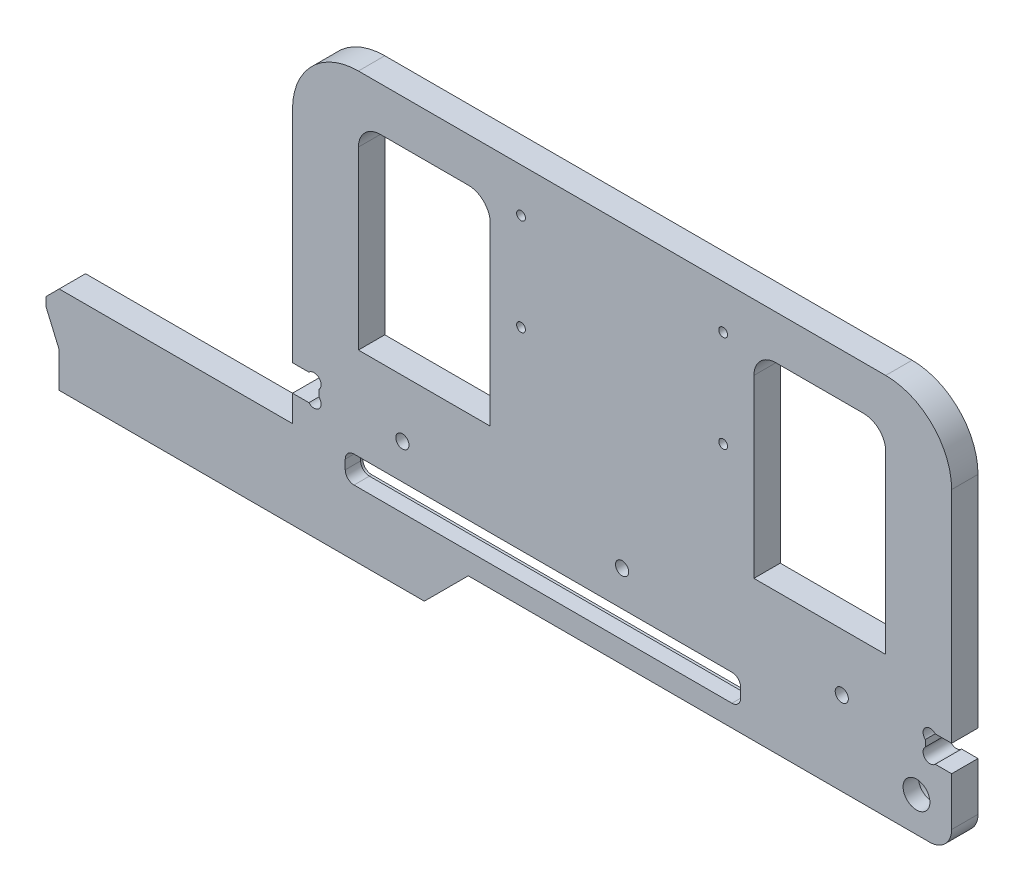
ISO-10303-21;
HEADER;
FILE_DESCRIPTION(('STEP AP214'),'2;1');
FILE_NAME('part.step','',(''),(''),'','','');
FILE_SCHEMA(('AUTOMOTIVE_DESIGN { 1 0 10303 214 1 1 1 1 }'));
ENDSEC;
DATA;
#1=APPLICATION_CONTEXT('core data for automotive mechanical design processes');
#2=APPLICATION_PROTOCOL_DEFINITION('international standard','automotive_design',2000,#1);
#3=PRODUCT_CONTEXT('',#1,'mechanical');
#4=PRODUCT('Part','Part','',(#3));
#5=PRODUCT_RELATED_PRODUCT_CATEGORY('part','',(#4));
#6=PRODUCT_DEFINITION_FORMATION('','',#4);
#7=PRODUCT_DEFINITION_CONTEXT('part definition',#1,'design');
#8=PRODUCT_DEFINITION('design','',#6,#7);
#9=PRODUCT_DEFINITION_SHAPE('','',#8);
#10=(LENGTH_UNIT() NAMED_UNIT(*) SI_UNIT(.MILLI.,.METRE.));
#11=(NAMED_UNIT(*) PLANE_ANGLE_UNIT() SI_UNIT($,.RADIAN.));
#12=(NAMED_UNIT(*) SI_UNIT($,.STERADIAN.) SOLID_ANGLE_UNIT());
#13=UNCERTAINTY_MEASURE_WITH_UNIT(LENGTH_MEASURE(1.E-05),#10,'distance_accuracy_value','');
#14=(GEOMETRIC_REPRESENTATION_CONTEXT(3) GLOBAL_UNCERTAINTY_ASSIGNED_CONTEXT((#13)) GLOBAL_UNIT_ASSIGNED_CONTEXT((#10,
#11,#12)) REPRESENTATION_CONTEXT('',''));
#15=CARTESIAN_POINT('',(0.,0.,0.));
#16=DIRECTION('',(0.,0.,1.));
#17=DIRECTION('',(1.,0.,0.));
#18=AXIS2_PLACEMENT_3D('',#15,#16,#17);
#19=CARTESIAN_POINT('',(-66.3614300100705,-21.8363544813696,0.));
#20=DIRECTION('',(-1.,0.,0.));
#21=DIRECTION('',(0.,0.,1.));
#22=AXIS2_PLACEMENT_3D('',#19,#20,#21);
#23=PLANE('',#22);
#24=DIRECTION('',(0.,-1.,0.));
#25=VECTOR('',#24,1.);
#26=CARTESIAN_POINT('',(-66.3614300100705,-21.8363544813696,2.5));
#27=LINE('',#26,#25);
#28=CARTESIAN_POINT('',(-66.3614300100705,-23.8363544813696,2.5));
#29=VERTEX_POINT('',#28);
#30=CARTESIAN_POINT('',(-66.3614300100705,-25.9363544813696,2.5));
#31=VERTEX_POINT('',#30);
#32=EDGE_CURVE('E600',#29,#31,#27,.T.);
#33=ORIENTED_EDGE('',*,*,#32,.F.);
#34=DIRECTION('',(0.,0.,1.));
#35=VECTOR('',#34,1.);
#36=CARTESIAN_POINT('',(-66.3614300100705,-23.8363544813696,6.));
#37=LINE('',#36,#35);
#38=CARTESIAN_POINT('',(-66.3614300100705,-23.8363544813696,6.));
#39=VERTEX_POINT('',#38);
#40=EDGE_CURVE('E842',#29,#39,#37,.T.);
#41=ORIENTED_EDGE('',*,*,#40,.T.);
#42=DIRECTION('',(0.,-1.,0.));
#43=VECTOR('',#42,1.);
#44=CARTESIAN_POINT('',(-66.3614300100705,-21.8363544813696,6.));
#45=LINE('',#44,#43);
#46=CARTESIAN_POINT('',(-66.3614300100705,-25.9363544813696,6.));
#47=VERTEX_POINT('',#46);
#48=EDGE_CURVE('E799',#39,#47,#45,.T.);
#49=ORIENTED_EDGE('',*,*,#48,.T.);
#50=DIRECTION('',(0.,0.,1.));
#51=VECTOR('',#50,1.);
#52=CARTESIAN_POINT('',(-66.3614300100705,-25.9363544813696,0.));
#53=LINE('',#52,#51);
#54=EDGE_CURVE('E839',#47,#31,#53,.F.);
#55=ORIENTED_EDGE('',*,*,#54,.T.);
#56=EDGE_LOOP('',(#33,#41,#49,#55));
#57=FACE_BOUND('',#56,.T.);
#58=ADVANCED_FACE('F34',(#57),#23,.F.);
#59=CARTESIAN_POINT('',(-66.3614300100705,-21.8363544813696,0.));
#60=DIRECTION('',(0.,1.,0.));
#61=DIRECTION('',(0.,0.,1.));
#62=AXIS2_PLACEMENT_3D('',#59,#60,#61);
#63=PLANE('',#62);
#64=DIRECTION('',(-1.,0.,0.));
#65=VECTOR('',#64,1.);
#66=CARTESIAN_POINT('',(-66.3614300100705,-21.8363544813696,2.5));
#67=LINE('',#66,#65);
#68=CARTESIAN_POINT('',(21.6385699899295,-21.8363544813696,2.5));
#69=VERTEX_POINT('',#68);
#70=CARTESIAN_POINT('',(-64.3614300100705,-21.8363544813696,2.5));
#71=VERTEX_POINT('',#70);
#72=EDGE_CURVE('E598',#69,#71,#67,.T.);
#73=ORIENTED_EDGE('',*,*,#72,.F.);
#74=DIRECTION('',(0.,0.,1.));
#75=VECTOR('',#74,1.);
#76=CARTESIAN_POINT('',(21.6385699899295,-21.8363544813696,6.));
#77=LINE('',#76,#75);
#78=CARTESIAN_POINT('',(21.6385699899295,-21.8363544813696,6.));
#79=VERTEX_POINT('',#78);
#80=EDGE_CURVE('E405',#69,#79,#77,.T.);
#81=ORIENTED_EDGE('',*,*,#80,.T.);
#82=DIRECTION('',(-1.,0.,0.));
#83=VECTOR('',#82,1.);
#84=CARTESIAN_POINT('',(-66.3614300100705,-21.8363544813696,6.));
#85=LINE('',#84,#83);
#86=CARTESIAN_POINT('',(-64.3614300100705,-21.8363544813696,6.));
#87=VERTEX_POINT('',#86);
#88=EDGE_CURVE('E807',#79,#87,#85,.T.);
#89=ORIENTED_EDGE('',*,*,#88,.T.);
#90=DIRECTION('',(0.,0.,1.));
#91=VECTOR('',#90,1.);
#92=CARTESIAN_POINT('',(-64.3614300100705,-21.8363544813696,0.));
#93=LINE('',#92,#91);
#94=EDGE_CURVE('E400',#87,#71,#93,.F.);
#95=ORIENTED_EDGE('',*,*,#94,.T.);
#96=EDGE_LOOP('',(#73,#81,#89,#95));
#97=FACE_BOUND('',#96,.T.);
#98=ADVANCED_FACE('F847',(#97),#63,.F.);
#99=CARTESIAN_POINT('',(23.6385699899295,-21.8363544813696,0.));
#100=DIRECTION('',(1.,0.,0.));
#101=DIRECTION('',(0.,0.,-1.));
#102=AXIS2_PLACEMENT_3D('',#99,#100,#101);
#103=PLANE('',#102);
#104=DIRECTION('',(0.,1.,0.));
#105=VECTOR('',#104,1.);
#106=CARTESIAN_POINT('',(23.6385699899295,-21.8363544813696,2.5));
#107=LINE('',#106,#105);
#108=CARTESIAN_POINT('',(23.6385699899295,-25.9363544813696,2.5));
#109=VERTEX_POINT('',#108);
#110=CARTESIAN_POINT('',(23.6385699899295,-23.8363544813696,2.5));
#111=VERTEX_POINT('',#110);
#112=EDGE_CURVE('E376',#109,#111,#107,.T.);
#113=ORIENTED_EDGE('',*,*,#112,.F.);
#114=DIRECTION('',(0.,0.,1.));
#115=VECTOR('',#114,1.);
#116=CARTESIAN_POINT('',(23.6385699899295,-25.9363544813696,6.));
#117=LINE('',#116,#115);
#118=CARTESIAN_POINT('',(23.6385699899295,-25.9363544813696,6.));
#119=VERTEX_POINT('',#118);
#120=EDGE_CURVE('E391',#109,#119,#117,.T.);
#121=ORIENTED_EDGE('',*,*,#120,.T.);
#122=DIRECTION('',(0.,1.,0.));
#123=VECTOR('',#122,1.);
#124=CARTESIAN_POINT('',(23.6385699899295,-21.8363544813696,6.));
#125=LINE('',#124,#123);
#126=CARTESIAN_POINT('',(23.6385699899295,-23.8363544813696,6.));
#127=VERTEX_POINT('',#126);
#128=EDGE_CURVE('E805',#119,#127,#125,.T.);
#129=ORIENTED_EDGE('',*,*,#128,.T.);
#130=DIRECTION('',(0.,0.,1.));
#131=VECTOR('',#130,1.);
#132=CARTESIAN_POINT('',(23.6385699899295,-23.8363544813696,0.));
#133=LINE('',#132,#131);
#134=EDGE_CURVE('E394',#127,#111,#133,.F.);
#135=ORIENTED_EDGE('',*,*,#134,.T.);
#136=EDGE_LOOP('',(#113,#121,#129,#135));
#137=FACE_BOUND('',#136,.T.);
#138=ADVANCED_FACE('F389',(#137),#103,.F.);
#139=CARTESIAN_POINT('',(-66.3614300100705,-27.9363544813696,0.));
#140=DIRECTION('',(0.,-1.,0.));
#141=DIRECTION('',(0.,0.,-1.));
#142=AXIS2_PLACEMENT_3D('',#139,#140,#141);
#143=PLANE('',#142);
#144=DIRECTION('',(1.,0.,0.));
#145=VECTOR('',#144,1.);
#146=CARTESIAN_POINT('',(-66.3614300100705,-27.9363544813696,2.5));
#147=LINE('',#146,#145);
#148=CARTESIAN_POINT('',(-64.3614300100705,-27.9363544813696,2.5));
#149=VERTEX_POINT('',#148);
#150=CARTESIAN_POINT('',(21.6385699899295,-27.9363544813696,2.5));
#151=VERTEX_POINT('',#150);
#152=EDGE_CURVE('E379',#149,#151,#147,.T.);
#153=ORIENTED_EDGE('',*,*,#152,.F.);
#154=DIRECTION('',(0.,0.,1.));
#155=VECTOR('',#154,1.);
#156=CARTESIAN_POINT('',(-64.3614300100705,-27.9363544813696,6.));
#157=LINE('',#156,#155);
#158=CARTESIAN_POINT('',(-64.3614300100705,-27.9363544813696,6.));
#159=VERTEX_POINT('',#158);
#160=EDGE_CURVE('E410',#149,#159,#157,.T.);
#161=ORIENTED_EDGE('',*,*,#160,.T.);
#162=DIRECTION('',(1.,0.,0.));
#163=VECTOR('',#162,1.);
#164=CARTESIAN_POINT('',(-66.3614300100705,-27.9363544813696,6.));
#165=LINE('',#164,#163);
#166=CARTESIAN_POINT('',(21.6385699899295,-27.9363544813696,6.));
#167=VERTEX_POINT('',#166);
#168=EDGE_CURVE('E802',#159,#167,#165,.T.);
#169=ORIENTED_EDGE('',*,*,#168,.T.);
#170=DIRECTION('',(0.,0.,1.));
#171=VECTOR('',#170,1.);
#172=CARTESIAN_POINT('',(21.6385699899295,-27.9363544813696,0.));
#173=LINE('',#172,#171);
#174=EDGE_CURVE('E402',#167,#151,#173,.F.);
#175=ORIENTED_EDGE('',*,*,#174,.T.);
#176=EDGE_LOOP('',(#153,#161,#169,#175));
#177=FACE_BOUND('',#176,.T.);
#178=ADVANCED_FACE('F871',(#177),#143,.F.);
#179=CARTESIAN_POINT('',(-64.3614300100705,-23.8363544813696,0.));
#180=DIRECTION('',(0.,0.,-1.));
#181=DIRECTION('',(-1.,0.,0.));
#182=AXIS2_PLACEMENT_3D('',#179,#180,#181);
#183=CYLINDRICAL_SURFACE('',#182,2.);
#184=CARTESIAN_POINT('',(-64.3614300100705,-23.8363544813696,2.5));
#185=DIRECTION('',(0.,0.,-1.));
#186=DIRECTION('',(-1.,0.,0.));
#187=AXIS2_PLACEMENT_3D('',#184,#185,#186);
#188=CIRCLE('',#187,2.);
#189=EDGE_CURVE('E602',#71,#29,#188,.F.);
#190=ORIENTED_EDGE('',*,*,#189,.F.);
#191=ORIENTED_EDGE('',*,*,#94,.F.);
#192=CARTESIAN_POINT('',(-64.3614300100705,-23.8363544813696,6.));
#193=DIRECTION('',(0.,0.,1.));
#194=DIRECTION('',(1.,0.,0.));
#195=AXIS2_PLACEMENT_3D('',#192,#193,#194);
#196=CIRCLE('',#195,2.);
#197=EDGE_CURVE('E412',#39,#87,#196,.F.);
#198=ORIENTED_EDGE('',*,*,#197,.F.);
#199=ORIENTED_EDGE('',*,*,#40,.F.);
#200=EDGE_LOOP('',(#190,#191,#198,#199));
#201=FACE_BOUND('',#200,.T.);
#202=ADVANCED_FACE('F860',(#201),#183,.F.);
#203=CARTESIAN_POINT('',(21.6385699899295,-23.8363544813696,0.));
#204=DIRECTION('',(0.,0.,-1.));
#205=DIRECTION('',(-1.,0.,0.));
#206=AXIS2_PLACEMENT_3D('',#203,#204,#205);
#207=CYLINDRICAL_SURFACE('',#206,2.);
#208=CARTESIAN_POINT('',(21.6385699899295,-23.8363544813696,2.5));
#209=DIRECTION('',(0.,0.,-1.));
#210=DIRECTION('',(-1.,0.,0.));
#211=AXIS2_PLACEMENT_3D('',#208,#209,#210);
#212=CIRCLE('',#211,2.);
#213=EDGE_CURVE('E596',#111,#69,#212,.F.);
#214=ORIENTED_EDGE('',*,*,#213,.F.);
#215=ORIENTED_EDGE('',*,*,#134,.F.);
#216=CARTESIAN_POINT('',(21.6385699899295,-23.8363544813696,6.));
#217=DIRECTION('',(0.,0.,1.));
#218=DIRECTION('',(1.,0.,0.));
#219=AXIS2_PLACEMENT_3D('',#216,#217,#218);
#220=CIRCLE('',#219,2.);
#221=EDGE_CURVE('E414',#79,#127,#220,.F.);
#222=ORIENTED_EDGE('',*,*,#221,.F.);
#223=ORIENTED_EDGE('',*,*,#80,.F.);
#224=EDGE_LOOP('',(#214,#215,#222,#223));
#225=FACE_BOUND('',#224,.T.);
#226=ADVANCED_FACE('F851',(#225),#207,.F.);
#227=CARTESIAN_POINT('',(-64.3614300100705,-25.9363544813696,0.));
#228=DIRECTION('',(0.,0.,-1.));
#229=DIRECTION('',(-1.,0.,0.));
#230=AXIS2_PLACEMENT_3D('',#227,#228,#229);
#231=CYLINDRICAL_SURFACE('',#230,2.);
#232=CARTESIAN_POINT('',(-64.3614300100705,-25.9363544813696,2.5));
#233=DIRECTION('',(0.,0.,-1.));
#234=DIRECTION('',(-1.,0.,0.));
#235=AXIS2_PLACEMENT_3D('',#232,#233,#234);
#236=CIRCLE('',#235,2.);
#237=EDGE_CURVE('E395',#31,#149,#236,.F.);
#238=ORIENTED_EDGE('',*,*,#237,.F.);
#239=ORIENTED_EDGE('',*,*,#54,.F.);
#240=CARTESIAN_POINT('',(-64.3614300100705,-25.9363544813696,6.));
#241=DIRECTION('',(0.,0.,1.));
#242=DIRECTION('',(1.,0.,0.));
#243=AXIS2_PLACEMENT_3D('',#240,#241,#242);
#244=CIRCLE('',#243,2.);
#245=EDGE_CURVE('E416',#159,#47,#244,.F.);
#246=ORIENTED_EDGE('',*,*,#245,.F.);
#247=ORIENTED_EDGE('',*,*,#160,.F.);
#248=EDGE_LOOP('',(#238,#239,#246,#247));
#249=FACE_BOUND('',#248,.T.);
#250=ADVANCED_FACE('F867',(#249),#231,.F.);
#251=CARTESIAN_POINT('',(21.6385699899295,-25.9363544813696,0.));
#252=DIRECTION('',(0.,0.,-1.));
#253=DIRECTION('',(-1.,0.,0.));
#254=AXIS2_PLACEMENT_3D('',#251,#252,#253);
#255=CYLINDRICAL_SURFACE('',#254,2.);
#256=CARTESIAN_POINT('',(21.6385699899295,-25.9363544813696,2.5));
#257=DIRECTION('',(0.,0.,-1.));
#258=DIRECTION('',(-1.,0.,0.));
#259=AXIS2_PLACEMENT_3D('',#256,#257,#258);
#260=CIRCLE('',#259,2.);
#261=EDGE_CURVE('E373',#151,#109,#260,.F.);
#262=ORIENTED_EDGE('',*,*,#261,.F.);
#263=ORIENTED_EDGE('',*,*,#174,.F.);
#264=CARTESIAN_POINT('',(21.6385699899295,-25.9363544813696,6.));
#265=DIRECTION('',(0.,0.,1.));
#266=DIRECTION('',(1.,0.,0.));
#267=AXIS2_PLACEMENT_3D('',#264,#265,#266);
#268=CIRCLE('',#267,2.);
#269=EDGE_CURVE('E398',#119,#167,#268,.F.);
#270=ORIENTED_EDGE('',*,*,#269,.F.);
#271=ORIENTED_EDGE('',*,*,#120,.F.);
#272=EDGE_LOOP('',(#262,#263,#270,#271));
#273=FACE_BOUND('',#272,.T.);
#274=ADVANCED_FACE('F397',(#273),#255,.F.);
#275=CARTESIAN_POINT('',(-53.3614300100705,-13.8363544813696,0.));
#276=DIRECTION('',(0.,0.,1.));
#277=DIRECTION('',(1.,0.,0.));
#278=AXIS2_PLACEMENT_3D('',#275,#276,#277);
#279=CYLINDRICAL_SURFACE('',#278,1.5);
#280=CARTESIAN_POINT('',(-53.3614300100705,-13.8363544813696,6.));
#281=DIRECTION('',(0.,0.,1.));
#282=DIRECTION('',(1.,0.,0.));
#283=AXIS2_PLACEMENT_3D('',#280,#281,#282);
#284=CIRCLE('',#283,1.5);
#285=CARTESIAN_POINT('',(-51.8614300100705,-13.8363544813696,6.));
#286=VERTEX_POINT('',#285);
#287=EDGE_CURVE('E796',#286,#286,#284,.T.);
#288=ORIENTED_EDGE('',*,*,#287,.T.);
#289=EDGE_LOOP('',(#288));
#290=FACE_BOUND('',#289,.T.);
#291=CARTESIAN_POINT('',(-53.3614300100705,-13.8363544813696,2.5));
#292=DIRECTION('',(0.,0.,-1.));
#293=DIRECTION('',(-1.,0.,0.));
#294=AXIS2_PLACEMENT_3D('',#291,#292,#293);
#295=CIRCLE('',#294,1.5);
#296=CARTESIAN_POINT('',(-54.8614300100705,-13.8363544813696,2.5));
#297=VERTEX_POINT('',#296);
#298=EDGE_CURVE('E524',#297,#297,#295,.F.);
#299=ORIENTED_EDGE('',*,*,#298,.F.);
#300=EDGE_LOOP('',(#299));
#301=FACE_BOUND('',#300,.T.);
#302=ADVANCED_FACE('F1117',(#290,#301),#279,.F.);
#303=CARTESIAN_POINT('',(-3.36143001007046,-13.8363544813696,0.));
#304=DIRECTION('',(0.,0.,1.));
#305=DIRECTION('',(1.,0.,0.));
#306=AXIS2_PLACEMENT_3D('',#303,#304,#305);
#307=CYLINDRICAL_SURFACE('',#306,1.5);
#308=CARTESIAN_POINT('',(-3.36143001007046,-13.8363544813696,6.));
#309=DIRECTION('',(0.,0.,1.));
#310=DIRECTION('',(1.,0.,0.));
#311=AXIS2_PLACEMENT_3D('',#308,#309,#310);
#312=CIRCLE('',#311,1.5);
#313=CARTESIAN_POINT('',(-1.86143001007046,-13.8363544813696,6.));
#314=VERTEX_POINT('',#313);
#315=EDGE_CURVE('E793',#314,#314,#312,.T.);
#316=ORIENTED_EDGE('',*,*,#315,.T.);
#317=EDGE_LOOP('',(#316));
#318=FACE_BOUND('',#317,.T.);
#319=CARTESIAN_POINT('',(-3.36143001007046,-13.8363544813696,2.5));
#320=DIRECTION('',(0.,0.,-1.));
#321=DIRECTION('',(-1.,0.,0.));
#322=AXIS2_PLACEMENT_3D('',#319,#320,#321);
#323=CIRCLE('',#322,1.5);
#324=CARTESIAN_POINT('',(-4.86143001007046,-13.8363544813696,2.5));
#325=VERTEX_POINT('',#324);
#326=EDGE_CURVE('E519',#325,#325,#323,.F.);
#327=ORIENTED_EDGE('',*,*,#326,.F.);
#328=EDGE_LOOP('',(#327));
#329=FACE_BOUND('',#328,.T.);
#330=ADVANCED_FACE('F1124',(#318,#329),#307,.F.);
#331=CARTESIAN_POINT('',(46.6385699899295,-13.8363544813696,0.));
#332=DIRECTION('',(0.,0.,1.));
#333=DIRECTION('',(1.,0.,0.));
#334=AXIS2_PLACEMENT_3D('',#331,#332,#333);
#335=CYLINDRICAL_SURFACE('',#334,1.5);
#336=CARTESIAN_POINT('',(46.6385699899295,-13.8363544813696,6.));
#337=DIRECTION('',(0.,0.,1.));
#338=DIRECTION('',(1.,0.,0.));
#339=AXIS2_PLACEMENT_3D('',#336,#337,#338);
#340=CIRCLE('',#339,1.5);
#341=CARTESIAN_POINT('',(48.1385699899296,-13.8363544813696,6.));
#342=VERTEX_POINT('',#341);
#343=EDGE_CURVE('E788',#342,#342,#340,.T.);
#344=ORIENTED_EDGE('',*,*,#343,.T.);
#345=EDGE_LOOP('',(#344));
#346=FACE_BOUND('',#345,.T.);
#347=CARTESIAN_POINT('',(46.6385699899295,-13.8363544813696,2.5));
#348=DIRECTION('',(0.,0.,-1.));
#349=DIRECTION('',(-1.,0.,0.));
#350=AXIS2_PLACEMENT_3D('',#347,#348,#349);
#351=CIRCLE('',#350,1.5);
#352=CARTESIAN_POINT('',(45.1385699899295,-13.8363544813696,2.5));
#353=VERTEX_POINT('',#352);
#354=EDGE_CURVE('E514',#353,#353,#351,.F.);
#355=ORIENTED_EDGE('',*,*,#354,.F.);
#356=EDGE_LOOP('',(#355));
#357=FACE_BOUND('',#356,.T.);
#358=ADVANCED_FACE('F890',(#346,#357),#335,.F.);
#359=CARTESIAN_POINT('',(63.6385699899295,-24.9363544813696,0.));
#360=DIRECTION('',(0.,0.,1.));
#361=DIRECTION('',(1.,0.,0.));
#362=AXIS2_PLACEMENT_3D('',#359,#360,#361);
#363=CYLINDRICAL_SURFACE('',#362,3.04999999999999);
#364=CARTESIAN_POINT('',(63.6385699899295,-24.9363544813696,6.));
#365=DIRECTION('',(0.,0.,1.));
#366=DIRECTION('',(1.,0.,0.));
#367=AXIS2_PLACEMENT_3D('',#364,#365,#366);
#368=CIRCLE('',#367,3.04999999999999);
#369=CARTESIAN_POINT('',(66.6885699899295,-24.9363544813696,6.));
#370=VERTEX_POINT('',#369);
#371=EDGE_CURVE('E810',#370,#370,#368,.T.);
#372=ORIENTED_EDGE('',*,*,#371,.T.);
#373=EDGE_LOOP('',(#372));
#374=FACE_BOUND('',#373,.T.);
#375=CARTESIAN_POINT('',(63.6385699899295,-24.9363544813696,2.5));
#376=DIRECTION('',(0.,0.,-1.));
#377=DIRECTION('',(-1.,0.,0.));
#378=AXIS2_PLACEMENT_3D('',#375,#376,#377);
#379=CIRCLE('',#378,3.04999999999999);
#380=CARTESIAN_POINT('',(60.5885699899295,-24.9363544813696,2.5));
#381=VERTEX_POINT('',#380);
#382=EDGE_CURVE('E509',#381,#381,#379,.F.);
#383=ORIENTED_EDGE('',*,*,#382,.F.);
#384=EDGE_LOOP('',(#383));
#385=FACE_BOUND('',#384,.T.);
#386=ADVANCED_FACE('F887',(#374,#385),#363,.F.);
#387=CARTESIAN_POINT('',(-78.3614300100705,54.1636455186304,6.));
#388=DIRECTION('',(1.,0.,0.));
#389=DIRECTION('',(0.,0.,-1.));
#390=AXIS2_PLACEMENT_3D('',#387,#388,#389);
#391=PLANE('',#390);
#392=DIRECTION('',(0.,0.,-1.));
#393=VECTOR('',#392,1.);
#394=CARTESIAN_POINT('',(-78.3614300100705,-22.8363544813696,0.));
#395=LINE('',#394,#393);
#396=CARTESIAN_POINT('',(-78.3614300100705,-22.8363544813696,6.));
#397=VERTEX_POINT('',#396);
#398=CARTESIAN_POINT('',(-78.3614300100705,-22.8363544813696,0.));
#399=VERTEX_POINT('',#398);
#400=EDGE_CURVE('E634',#397,#399,#395,.T.);
#401=ORIENTED_EDGE('',*,*,#400,.F.);
#402=DIRECTION('',(0.,-1.,0.));
#403=VECTOR('',#402,1.);
#404=CARTESIAN_POINT('',(-78.3614300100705,54.1636455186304,6.));
#405=LINE('',#404,#403);
#406=CARTESIAN_POINT('',(-78.3614300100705,-16.8363544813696,6.));
#407=VERTEX_POINT('',#406);
#408=EDGE_CURVE('E826',#407,#397,#405,.T.);
#409=ORIENTED_EDGE('',*,*,#408,.F.);
#410=DIRECTION('',(0.,0.,1.));
#411=VECTOR('',#410,1.);
#412=CARTESIAN_POINT('',(-78.3614300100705,-16.8363544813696,0.));
#413=LINE('',#412,#411);
#414=CARTESIAN_POINT('',(-78.3614300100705,-16.8363544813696,0.));
#415=VERTEX_POINT('',#414);
#416=EDGE_CURVE('E710',#415,#407,#413,.T.);
#417=ORIENTED_EDGE('',*,*,#416,.F.);
#418=DIRECTION('',(0.,-1.,0.));
#419=VECTOR('',#418,1.);
#420=CARTESIAN_POINT('',(-78.3614300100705,54.1636455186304,0.));
#421=LINE('',#420,#419);
#422=EDGE_CURVE('E813',#415,#399,#421,.T.);
#423=ORIENTED_EDGE('',*,*,#422,.T.);
#424=EDGE_LOOP('',(#401,#409,#417,#423));
#425=FACE_BOUND('',#424,.T.);
#426=ADVANCED_FACE('F36',(#425),#391,.F.);
#427=CARTESIAN_POINT('',(-78.3614300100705,39.1636455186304,0.));
#428=VERTEX_POINT('',#427);
#429=CARTESIAN_POINT('',(-78.3614300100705,-10.8363544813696,0.));
#430=VERTEX_POINT('',#429);
#431=EDGE_CURVE('E814',#428,#430,#421,.T.);
#432=ORIENTED_EDGE('',*,*,#431,.T.);
#433=DIRECTION('',(0.,0.,1.));
#434=VECTOR('',#433,1.);
#435=CARTESIAN_POINT('',(-78.3614300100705,-10.8363544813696,0.));
#436=LINE('',#435,#434);
#437=CARTESIAN_POINT('',(-78.3614300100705,-10.8363544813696,6.));
#438=VERTEX_POINT('',#437);
#439=EDGE_CURVE('E711',#430,#438,#436,.T.);
#440=ORIENTED_EDGE('',*,*,#439,.T.);
#441=CARTESIAN_POINT('',(-78.3614300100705,39.1636455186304,6.));
#442=VERTEX_POINT('',#441);
#443=EDGE_CURVE('E827',#442,#438,#405,.T.);
#444=ORIENTED_EDGE('',*,*,#443,.F.);
#445=DIRECTION('',(0.,0.,-1.));
#446=VECTOR('',#445,1.);
#447=CARTESIAN_POINT('',(-78.3614300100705,39.1636455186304,6.));
#448=LINE('',#447,#446);
#449=EDGE_CURVE('E455',#442,#428,#448,.T.);
#450=ORIENTED_EDGE('',*,*,#449,.T.);
#451=EDGE_LOOP('',(#432,#440,#444,#450));
#452=FACE_BOUND('',#451,.T.);
#453=ADVANCED_FACE('F913',(#452),#391,.F.);
#454=CARTESIAN_POINT('',(71.6385699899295,54.1636455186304,6.));
#455=DIRECTION('',(-1.,0.,0.));
#456=DIRECTION('',(0.,-1.,0.));
#457=AXIS2_PLACEMENT_3D('',#454,#455,#456);
#458=PLANE('',#457);
#459=DIRECTION('',(0.,1.,0.));
#460=VECTOR('',#459,1.);
#461=CARTESIAN_POINT('',(71.6385699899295,54.1636455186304,6.));
#462=LINE('',#461,#460);
#463=CARTESIAN_POINT('',(71.6385699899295,-10.8363544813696,6.));
#464=VERTEX_POINT('',#463);
#465=CARTESIAN_POINT('',(71.6385699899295,39.1636455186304,6.));
#466=VERTEX_POINT('',#465);
#467=EDGE_CURVE('E832',#464,#466,#462,.T.);
#468=ORIENTED_EDGE('',*,*,#467,.F.);
#469=DIRECTION('',(0.,0.,1.));
#470=VECTOR('',#469,1.);
#471=CARTESIAN_POINT('',(71.6385699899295,-10.8363544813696,0.));
#472=LINE('',#471,#470);
#473=CARTESIAN_POINT('',(71.6385699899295,-10.8363544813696,0.));
#474=VERTEX_POINT('',#473);
#475=EDGE_CURVE('E732',#474,#464,#472,.T.);
#476=ORIENTED_EDGE('',*,*,#475,.F.);
#477=DIRECTION('',(0.,1.,0.));
#478=VECTOR('',#477,1.);
#479=CARTESIAN_POINT('',(71.6385699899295,54.1636455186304,0.));
#480=LINE('',#479,#478);
#481=CARTESIAN_POINT('',(71.6385699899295,39.1636455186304,0.));
#482=VERTEX_POINT('',#481);
#483=EDGE_CURVE('E819',#474,#482,#480,.T.);
#484=ORIENTED_EDGE('',*,*,#483,.T.);
#485=DIRECTION('',(0.,0.,-1.));
#486=VECTOR('',#485,1.);
#487=CARTESIAN_POINT('',(71.6385699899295,39.1636455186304,6.));
#488=LINE('',#487,#486);
#489=EDGE_CURVE('E472',#482,#466,#488,.F.);
#490=ORIENTED_EDGE('',*,*,#489,.T.);
#491=EDGE_LOOP('',(#468,#476,#484,#490));
#492=FACE_BOUND('',#491,.T.);
#493=ADVANCED_FACE('F907',(#492),#458,.F.);
#494=CARTESIAN_POINT('',(-78.3614300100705,-32.8363544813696,6.));
#495=DIRECTION('',(0.,1.,0.));
#496=DIRECTION('',(0.,0.,1.));
#497=AXIS2_PLACEMENT_3D('',#494,#495,#496);
#498=PLANE('',#497);
#499=DIRECTION('',(1.,0.,0.));
#500=VECTOR('',#499,1.);
#501=CARTESIAN_POINT('',(-78.3614300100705,-32.8363544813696,6.));
#502=LINE('',#501,#500);
#503=CARTESIAN_POINT('',(-38.3614300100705,-32.8363544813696,6.));
#504=VERTEX_POINT('',#503);
#505=CARTESIAN_POINT('',(66.6385699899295,-32.8363544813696,6.));
#506=VERTEX_POINT('',#505);
#507=EDGE_CURVE('E830',#504,#506,#502,.T.);
#508=ORIENTED_EDGE('',*,*,#507,.F.);
#509=DIRECTION('',(0.,0.,1.));
#510=VECTOR('',#509,1.);
#511=CARTESIAN_POINT('',(-38.3614300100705,-32.8363544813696,0.));
#512=LINE('',#511,#510);
#513=CARTESIAN_POINT('',(-38.3614300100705,-32.8363544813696,0.));
#514=VERTEX_POINT('',#513);
#515=EDGE_CURVE('E659',#514,#504,#512,.T.);
#516=ORIENTED_EDGE('',*,*,#515,.F.);
#517=DIRECTION('',(1.,0.,0.));
#518=VECTOR('',#517,1.);
#519=CARTESIAN_POINT('',(-78.3614300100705,-32.8363544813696,0.));
#520=LINE('',#519,#518);
#521=CARTESIAN_POINT('',(66.6385699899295,-32.8363544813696,0.));
#522=VERTEX_POINT('',#521);
#523=EDGE_CURVE('E817',#514,#522,#520,.T.);
#524=ORIENTED_EDGE('',*,*,#523,.T.);
#525=DIRECTION('',(0.,0.,-1.));
#526=VECTOR('',#525,1.);
#527=CARTESIAN_POINT('',(66.6385699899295,-32.8363544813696,6.));
#528=LINE('',#527,#526);
#529=EDGE_CURVE('E481',#522,#506,#528,.F.);
#530=ORIENTED_EDGE('',*,*,#529,.T.);
#531=EDGE_LOOP('',(#508,#516,#524,#530));
#532=FACE_BOUND('',#531,.T.);
#533=ADVANCED_FACE('F905',(#532),#498,.F.);
#534=CARTESIAN_POINT('',(71.6385699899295,-27.8363544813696,6.));
#535=VERTEX_POINT('',#534);
#536=CARTESIAN_POINT('',(71.6385699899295,-16.8363544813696,6.));
#537=VERTEX_POINT('',#536);
#538=EDGE_CURVE('E833',#535,#537,#462,.T.);
#539=ORIENTED_EDGE('',*,*,#538,.F.);
#540=DIRECTION('',(0.,0.,-1.));
#541=VECTOR('',#540,1.);
#542=CARTESIAN_POINT('',(71.6385699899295,-27.8363544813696,6.));
#543=LINE('',#542,#541);
#544=CARTESIAN_POINT('',(71.6385699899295,-27.8363544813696,0.));
#545=VERTEX_POINT('',#544);
#546=EDGE_CURVE('E475',#535,#545,#543,.T.);
#547=ORIENTED_EDGE('',*,*,#546,.T.);
#548=CARTESIAN_POINT('',(71.6385699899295,-16.8363544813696,0.));
#549=VERTEX_POINT('',#548);
#550=EDGE_CURVE('E820',#545,#549,#480,.T.);
#551=ORIENTED_EDGE('',*,*,#550,.T.);
#552=DIRECTION('',(0.,0.,1.));
#553=VECTOR('',#552,1.);
#554=CARTESIAN_POINT('',(71.6385699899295,-16.8363544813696,0.));
#555=LINE('',#554,#553);
#556=EDGE_CURVE('E731',#549,#537,#555,.T.);
#557=ORIENTED_EDGE('',*,*,#556,.T.);
#558=EDGE_LOOP('',(#539,#547,#551,#557));
#559=FACE_BOUND('',#558,.T.);
#560=ADVANCED_FACE('F902',(#559),#458,.F.);
#561=CARTESIAN_POINT('',(-78.3614300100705,54.1636455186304,6.));
#562=DIRECTION('',(0.,-1.,0.));
#563=DIRECTION('',(0.,0.,-1.));
#564=AXIS2_PLACEMENT_3D('',#561,#562,#563);
#565=PLANE('',#564);
#566=DIRECTION('',(-1.,0.,0.));
#567=VECTOR('',#566,1.);
#568=CARTESIAN_POINT('',(-78.3614300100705,54.1636455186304,0.));
#569=LINE('',#568,#567);
#570=CARTESIAN_POINT('',(56.6385699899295,54.1636455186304,0.));
#571=VERTEX_POINT('',#570);
#572=CARTESIAN_POINT('',(-63.3614300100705,54.1636455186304,0.));
#573=VERTEX_POINT('',#572);
#574=EDGE_CURVE('E823',#571,#573,#569,.T.);
#575=ORIENTED_EDGE('',*,*,#574,.T.);
#576=DIRECTION('',(0.,0.,-1.));
#577=VECTOR('',#576,1.);
#578=CARTESIAN_POINT('',(-63.3614300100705,54.1636455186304,6.));
#579=LINE('',#578,#577);
#580=CARTESIAN_POINT('',(-63.3614300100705,54.1636455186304,6.));
#581=VERTEX_POINT('',#580);
#582=EDGE_CURVE('E466',#573,#581,#579,.F.);
#583=ORIENTED_EDGE('',*,*,#582,.T.);
#584=DIRECTION('',(-1.,0.,0.));
#585=VECTOR('',#584,1.);
#586=CARTESIAN_POINT('',(-78.3614300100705,54.1636455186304,6.));
#587=LINE('',#586,#585);
#588=CARTESIAN_POINT('',(56.6385699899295,54.1636455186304,6.));
#589=VERTEX_POINT('',#588);
#590=EDGE_CURVE('E836',#589,#581,#587,.T.);
#591=ORIENTED_EDGE('',*,*,#590,.F.);
#592=DIRECTION('',(0.,0.,-1.));
#593=VECTOR('',#592,1.);
#594=CARTESIAN_POINT('',(56.6385699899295,54.1636455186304,6.));
#595=LINE('',#594,#593);
#596=EDGE_CURVE('E463',#589,#571,#595,.T.);
#597=ORIENTED_EDGE('',*,*,#596,.T.);
#598=EDGE_LOOP('',(#575,#583,#591,#597));
#599=FACE_BOUND('',#598,.T.);
#600=ADVANCED_FACE('F898',(#599),#565,.F.);
#601=CARTESIAN_POINT('',(-78.3614300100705,-32.8363544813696,6.));
#602=DIRECTION('',(0.,0.,1.));
#603=DIRECTION('',(1.,0.,0.));
#604=AXIS2_PLACEMENT_3D('',#601,#602,#603);
#605=PLANE('',#604);
#606=CARTESIAN_POINT('',(19.6385699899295,22.1636455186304,6.));
#607=DIRECTION('',(0.,0.,1.));
#608=DIRECTION('',(1.,0.,0.));
#609=AXIS2_PLACEMENT_3D('',#606,#607,#608);
#610=CIRCLE('',#609,1.);
#611=CARTESIAN_POINT('',(20.6385699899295,22.1636455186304,6.));
#612=VERTEX_POINT('',#611);
#613=EDGE_CURVE('E1397',#612,#612,#610,.T.);
#614=ORIENTED_EDGE('',*,*,#613,.F.);
#615=EDGE_LOOP('',(#614));
#616=FACE_BOUND('',#615,.T.);
#617=CARTESIAN_POINT('',(-26.3614300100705,22.1636455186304,6.));
#618=DIRECTION('',(0.,0.,1.));
#619=DIRECTION('',(1.,0.,0.));
#620=AXIS2_PLACEMENT_3D('',#617,#618,#619);
#621=CIRCLE('',#620,1.);
#622=CARTESIAN_POINT('',(-25.3614300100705,22.1636455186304,6.));
#623=VERTEX_POINT('',#622);
#624=EDGE_CURVE('E1399',#623,#623,#621,.T.);
#625=ORIENTED_EDGE('',*,*,#624,.F.);
#626=EDGE_LOOP('',(#625));
#627=FACE_BOUND('',#626,.T.);
#628=CARTESIAN_POINT('',(19.6385699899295,44.1636455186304,6.));
#629=DIRECTION('',(0.,0.,1.));
#630=DIRECTION('',(1.,0.,0.));
#631=AXIS2_PLACEMENT_3D('',#628,#629,#630);
#632=CIRCLE('',#631,1.);
#633=CARTESIAN_POINT('',(20.6385699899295,44.1636455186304,6.));
#634=VERTEX_POINT('',#633);
#635=EDGE_CURVE('E1407',#634,#634,#632,.T.);
#636=ORIENTED_EDGE('',*,*,#635,.F.);
#637=EDGE_LOOP('',(#636));
#638=FACE_BOUND('',#637,.T.);
#639=CARTESIAN_POINT('',(-26.3614300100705,44.1636455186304,6.));
#640=DIRECTION('',(0.,0.,1.));
#641=DIRECTION('',(1.,0.,0.));
#642=AXIS2_PLACEMENT_3D('',#639,#640,#641);
#643=CIRCLE('',#642,1.);
#644=CARTESIAN_POINT('',(-25.3614300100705,44.1636455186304,6.));
#645=VERTEX_POINT('',#644);
#646=EDGE_CURVE('E1413',#645,#645,#643,.T.);
#647=ORIENTED_EDGE('',*,*,#646,.F.);
#648=EDGE_LOOP('',(#647));
#649=FACE_BOUND('',#648,.T.);
#650=DIRECTION('',(-0.393919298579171,0.919145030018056,0.));
#651=VECTOR('',#650,1.);
#652=CARTESIAN_POINT('',(-131.46143001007,-34.8363544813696,6.));
#653=LINE('',#652,#651);
#654=CARTESIAN_POINT('',(-131.46143001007,-34.8363544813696,6.));
#655=VERTEX_POINT('',#654);
#656=CARTESIAN_POINT('',(-134.461430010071,-27.8363544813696,6.));
#657=VERTEX_POINT('',#656);
#658=EDGE_CURVE('E622',#655,#657,#653,.T.);
#659=ORIENTED_EDGE('',*,*,#658,.F.);
#660=DIRECTION('',(0.,1.,0.));
#661=VECTOR('',#660,1.);
#662=CARTESIAN_POINT('',(-131.46143001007,-42.8363544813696,6.));
#663=LINE('',#662,#661);
#664=CARTESIAN_POINT('',(-131.46143001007,-42.8363544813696,6.));
#665=VERTEX_POINT('',#664);
#666=EDGE_CURVE('E512',#665,#655,#663,.T.);
#667=ORIENTED_EDGE('',*,*,#666,.F.);
#668=DIRECTION('',(1.,0.,0.));
#669=VECTOR('',#668,1.);
#670=CARTESIAN_POINT('',(-78.3614300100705,-42.8363544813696,6.));
#671=LINE('',#670,#669);
#672=CARTESIAN_POINT('',(-48.3614300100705,-42.8363544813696,6.));
#673=VERTEX_POINT('',#672);
#674=EDGE_CURVE('E648',#665,#673,#671,.T.);
#675=ORIENTED_EDGE('',*,*,#674,.T.);
#676=DIRECTION('',(0.707106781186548,0.707106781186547,0.));
#677=VECTOR('',#676,1.);
#678=CARTESIAN_POINT('',(-48.3614300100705,-42.8363544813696,6.));
#679=LINE('',#678,#677);
#680=EDGE_CURVE('E650',#673,#504,#679,.T.);
#681=ORIENTED_EDGE('',*,*,#680,.T.);
#682=ORIENTED_EDGE('',*,*,#507,.T.);
#683=CARTESIAN_POINT('',(66.6385699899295,-27.8363544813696,6.));
#684=DIRECTION('',(0.,0.,1.));
#685=DIRECTION('',(1.,0.,0.));
#686=AXIS2_PLACEMENT_3D('',#683,#684,#685);
#687=CIRCLE('',#686,5.);
#688=EDGE_CURVE('E484',#506,#535,#687,.T.);
#689=ORIENTED_EDGE('',*,*,#688,.T.);
#690=ORIENTED_EDGE('',*,*,#538,.T.);
#691=DIRECTION('',(1.,0.,0.));
#692=VECTOR('',#691,1.);
#693=CARTESIAN_POINT('',(65.6385699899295,-16.8363544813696,6.));
#694=LINE('',#693,#692);
#695=CARTESIAN_POINT('',(67.9004649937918,-16.8363544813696,6.));
#696=VERTEX_POINT('',#695);
#697=EDGE_CURVE('E718',#696,#537,#694,.T.);
#698=ORIENTED_EDGE('',*,*,#697,.F.);
#699=CARTESIAN_POINT('',(66.7385699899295,-15.7363544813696,6.));
#700=DIRECTION('',(0.,0.,1.));
#701=DIRECTION('',(1.,0.,0.));
#702=AXIS2_PLACEMENT_3D('',#699,#700,#701);
#703=CIRCLE('',#702,1.6);
#704=CARTESIAN_POINT('',(65.6385699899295,-14.5744594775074,6.));
#705=VERTEX_POINT('',#704);
#706=EDGE_CURVE('E662',#705,#696,#703,.T.);
#707=ORIENTED_EDGE('',*,*,#706,.F.);
#708=DIRECTION('',(0.,-1.,0.));
#709=VECTOR('',#708,1.);
#710=CARTESIAN_POINT('',(65.6385699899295,-10.8363544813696,6.));
#711=LINE('',#710,#709);
#712=CARTESIAN_POINT('',(65.6385699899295,-13.0982494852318,6.));
#713=VERTEX_POINT('',#712);
#714=EDGE_CURVE('E714',#713,#705,#711,.T.);
#715=ORIENTED_EDGE('',*,*,#714,.F.);
#716=CARTESIAN_POINT('',(66.7385699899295,-11.9363544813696,6.));
#717=DIRECTION('',(0.,0.,1.));
#718=DIRECTION('',(1.,0.,0.));
#719=AXIS2_PLACEMENT_3D('',#716,#717,#718);
#720=CIRCLE('',#719,1.6);
#721=CARTESIAN_POINT('',(67.9004649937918,-10.8363544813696,6.));
#722=VERTEX_POINT('',#721);
#723=EDGE_CURVE('E672',#722,#713,#720,.T.);
#724=ORIENTED_EDGE('',*,*,#723,.F.);
#725=DIRECTION('',(-1.,0.,0.));
#726=VECTOR('',#725,1.);
#727=CARTESIAN_POINT('',(65.6385699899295,-10.8363544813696,6.));
#728=LINE('',#727,#726);
#729=EDGE_CURVE('E720',#464,#722,#728,.T.);
#730=ORIENTED_EDGE('',*,*,#729,.F.);
#731=ORIENTED_EDGE('',*,*,#467,.T.);
#732=CARTESIAN_POINT('',(56.6385699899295,39.1636455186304,6.));
#733=DIRECTION('',(0.,0.,1.));
#734=DIRECTION('',(1.,0.,0.));
#735=AXIS2_PLACEMENT_3D('',#732,#733,#734);
#736=CIRCLE('',#735,15.);
#737=EDGE_CURVE('E468',#466,#589,#736,.T.);
#738=ORIENTED_EDGE('',*,*,#737,.T.);
#739=ORIENTED_EDGE('',*,*,#590,.T.);
#740=CARTESIAN_POINT('',(-63.3614300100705,39.1636455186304,6.));
#741=DIRECTION('',(0.,0.,1.));
#742=DIRECTION('',(1.,0.,0.));
#743=AXIS2_PLACEMENT_3D('',#740,#741,#742);
#744=CIRCLE('',#743,15.);
#745=EDGE_CURVE('E470',#581,#442,#744,.T.);
#746=ORIENTED_EDGE('',*,*,#745,.T.);
#747=ORIENTED_EDGE('',*,*,#443,.T.);
#748=DIRECTION('',(-1.,0.,0.));
#749=VECTOR('',#748,1.);
#750=CARTESIAN_POINT('',(-78.3614300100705,-10.8363544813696,6.));
#751=LINE('',#750,#749);
#752=CARTESIAN_POINT('',(-74.6233250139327,-10.8363544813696,6.));
#753=VERTEX_POINT('',#752);
#754=EDGE_CURVE('E701',#753,#438,#751,.T.);
#755=ORIENTED_EDGE('',*,*,#754,.F.);
#756=CARTESIAN_POINT('',(-73.4614300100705,-11.9363544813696,6.));
#757=DIRECTION('',(0.,0.,1.));
#758=DIRECTION('',(1.,0.,0.));
#759=AXIS2_PLACEMENT_3D('',#756,#757,#758);
#760=CIRCLE('',#759,1.6);
#761=CARTESIAN_POINT('',(-72.3614300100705,-13.0982494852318,6.));
#762=VERTEX_POINT('',#761);
#763=EDGE_CURVE('E688',#762,#753,#760,.T.);
#764=ORIENTED_EDGE('',*,*,#763,.F.);
#765=DIRECTION('',(0.,1.,0.));
#766=VECTOR('',#765,1.);
#767=CARTESIAN_POINT('',(-72.3614300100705,-10.8363544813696,6.));
#768=LINE('',#767,#766);
#769=CARTESIAN_POINT('',(-72.3614300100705,-14.5744594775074,6.));
#770=VERTEX_POINT('',#769);
#771=EDGE_CURVE('E699',#770,#762,#768,.T.);
#772=ORIENTED_EDGE('',*,*,#771,.F.);
#773=CARTESIAN_POINT('',(-73.4614300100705,-15.7363544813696,6.));
#774=DIRECTION('',(0.,0.,1.));
#775=DIRECTION('',(1.,0.,0.));
#776=AXIS2_PLACEMENT_3D('',#773,#774,#775);
#777=CIRCLE('',#776,1.6);
#778=CARTESIAN_POINT('',(-74.6233250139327,-16.8363544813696,6.));
#779=VERTEX_POINT('',#778);
#780=EDGE_CURVE('E680',#779,#770,#777,.T.);
#781=ORIENTED_EDGE('',*,*,#780,.F.);
#782=DIRECTION('',(1.,0.,0.));
#783=VECTOR('',#782,1.);
#784=CARTESIAN_POINT('',(-78.3614300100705,-16.8363544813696,6.));
#785=LINE('',#784,#783);
#786=EDGE_CURVE('E696',#407,#779,#785,.T.);
#787=ORIENTED_EDGE('',*,*,#786,.F.);
#788=ORIENTED_EDGE('',*,*,#408,.T.);
#789=DIRECTION('',(1.,0.,0.));
#790=VECTOR('',#789,1.);
#791=CARTESIAN_POINT('',(-134.461430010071,-22.8363544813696,6.));
#792=LINE('',#791,#790);
#793=CARTESIAN_POINT('',(-131.46143001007,-22.8363544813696,6.));
#794=VERTEX_POINT('',#793);
#795=EDGE_CURVE('E646',#794,#397,#792,.T.);
#796=ORIENTED_EDGE('',*,*,#795,.F.);
#797=DIRECTION('',(-0.707106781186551,-0.707106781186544,0.));
#798=VECTOR('',#797,1.);
#799=CARTESIAN_POINT('',(-109.91143001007,-1.28635448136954,6.));
#800=LINE('',#799,#798);
#801=CARTESIAN_POINT('',(-134.461430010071,-25.8363544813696,6.));
#802=VERTEX_POINT('',#801);
#803=EDGE_CURVE('E505',#794,#802,#800,.T.);
#804=ORIENTED_EDGE('',*,*,#803,.T.);
#805=DIRECTION('',(0.,1.,0.));
#806=VECTOR('',#805,1.);
#807=CARTESIAN_POINT('',(-134.461430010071,-22.8363544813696,6.));
#808=LINE('',#807,#806);
#809=EDGE_CURVE('E642',#657,#802,#808,.T.);
#810=ORIENTED_EDGE('',*,*,#809,.F.);
#811=EDGE_LOOP('',(#659,#667,#675,#681,#682,#689,#690,#698,#707,#715,#724,#730,#731,#738,#739,
#746,#747,#755,#764,#772,#781,#787,#788,#796,#804,#810));
#812=FACE_BOUND('',#811,.T.);
#813=DIRECTION('',(0.,-1.,0.));
#814=VECTOR('',#813,1.);
#815=CARTESIAN_POINT('',(-63.3614300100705,44.1636455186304,6.));
#816=LINE('',#815,#814);
#817=CARTESIAN_POINT('',(-63.3614300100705,39.1636455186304,6.));
#818=VERTEX_POINT('',#817);
#819=CARTESIAN_POINT('',(-63.3614300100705,-0.836354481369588,6.));
#820=VERTEX_POINT('',#819);
#821=EDGE_CURVE('E734',#818,#820,#816,.T.);
#822=ORIENTED_EDGE('',*,*,#821,.F.);
#823=CARTESIAN_POINT('',(-58.3614300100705,39.1636455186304,6.));
#824=DIRECTION('',(0.,0.,1.));
#825=DIRECTION('',(1.,0.,0.));
#826=AXIS2_PLACEMENT_3D('',#823,#824,#825);
#827=CIRCLE('',#826,5.);
#828=CARTESIAN_POINT('',(-58.3614300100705,44.1636455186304,6.));
#829=VERTEX_POINT('',#828);
#830=EDGE_CURVE('E451',#818,#829,#827,.F.);
#831=ORIENTED_EDGE('',*,*,#830,.T.);
#832=DIRECTION('',(-1.,0.,0.));
#833=VECTOR('',#832,1.);
#834=CARTESIAN_POINT('',(-63.3614300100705,44.1636455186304,6.));
#835=LINE('',#834,#833);
#836=CARTESIAN_POINT('',(-38.3614300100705,44.1636455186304,6.));
#837=VERTEX_POINT('',#836);
#838=EDGE_CURVE('E744',#837,#829,#835,.T.);
#839=ORIENTED_EDGE('',*,*,#838,.F.);
#840=CARTESIAN_POINT('',(-38.3614300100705,39.1636455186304,6.));
#841=DIRECTION('',(0.,0.,1.));
#842=DIRECTION('',(1.,0.,0.));
#843=AXIS2_PLACEMENT_3D('',#840,#841,#842);
#844=CIRCLE('',#843,5.);
#845=CARTESIAN_POINT('',(-33.3614300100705,39.1636455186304,6.));
#846=VERTEX_POINT('',#845);
#847=EDGE_CURVE('E443',#837,#846,#844,.F.);
#848=ORIENTED_EDGE('',*,*,#847,.T.);
#849=DIRECTION('',(0.,1.,0.));
#850=VECTOR('',#849,1.);
#851=CARTESIAN_POINT('',(-33.3614300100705,44.1636455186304,6.));
#852=LINE('',#851,#850);
#853=CARTESIAN_POINT('',(-33.3614300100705,-0.836354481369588,6.));
#854=VERTEX_POINT('',#853);
#855=EDGE_CURVE('E741',#854,#846,#852,.T.);
#856=ORIENTED_EDGE('',*,*,#855,.F.);
#857=DIRECTION('',(1.,0.,0.));
#858=VECTOR('',#857,1.);
#859=CARTESIAN_POINT('',(-63.3614300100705,-0.836354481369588,6.));
#860=LINE('',#859,#858);
#861=EDGE_CURVE('E738',#820,#854,#860,.T.);
#862=ORIENTED_EDGE('',*,*,#861,.F.);
#863=EDGE_LOOP('',(#822,#831,#839,#848,#856,#862));
#864=FACE_BOUND('',#863,.T.);
#865=DIRECTION('',(0.,-1.,0.));
#866=VECTOR('',#865,1.);
#867=CARTESIAN_POINT('',(26.6385699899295,44.1636455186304,6.));
#868=LINE('',#867,#866);
#869=CARTESIAN_POINT('',(26.6385699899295,39.1636455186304,6.));
#870=VERTEX_POINT('',#869);
#871=CARTESIAN_POINT('',(26.6385699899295,-0.836354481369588,6.));
#872=VERTEX_POINT('',#871);
#873=EDGE_CURVE('E761',#870,#872,#868,.T.);
#874=ORIENTED_EDGE('',*,*,#873,.F.);
#875=CARTESIAN_POINT('',(31.6385699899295,39.1636455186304,6.));
#876=DIRECTION('',(0.,0.,1.));
#877=DIRECTION('',(1.,0.,0.));
#878=AXIS2_PLACEMENT_3D('',#875,#876,#877);
#879=CIRCLE('',#878,5.);
#880=CARTESIAN_POINT('',(31.6385699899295,44.1636455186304,6.));
#881=VERTEX_POINT('',#880);
#882=EDGE_CURVE('E447',#870,#881,#879,.F.);
#883=ORIENTED_EDGE('',*,*,#882,.T.);
#884=DIRECTION('',(-1.,0.,0.));
#885=VECTOR('',#884,1.);
#886=CARTESIAN_POINT('',(26.6385699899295,44.1636455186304,6.));
#887=LINE('',#886,#885);
#888=CARTESIAN_POINT('',(51.6385699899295,44.1636455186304,6.));
#889=VERTEX_POINT('',#888);
#890=EDGE_CURVE('E771',#889,#881,#887,.T.);
#891=ORIENTED_EDGE('',*,*,#890,.F.);
#892=CARTESIAN_POINT('',(51.6385699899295,39.1636455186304,6.));
#893=DIRECTION('',(0.,0.,1.));
#894=DIRECTION('',(1.,0.,0.));
#895=AXIS2_PLACEMENT_3D('',#892,#893,#894);
#896=CIRCLE('',#895,5.);
#897=CARTESIAN_POINT('',(56.6385699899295,39.1636455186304,6.));
#898=VERTEX_POINT('',#897);
#899=EDGE_CURVE('E439',#889,#898,#896,.F.);
#900=ORIENTED_EDGE('',*,*,#899,.T.);
#901=DIRECTION('',(0.,1.,0.));
#902=VECTOR('',#901,1.);
#903=CARTESIAN_POINT('',(56.6385699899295,44.1636455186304,6.));
#904=LINE('',#903,#902);
#905=CARTESIAN_POINT('',(56.6385699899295,-0.836354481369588,6.));
#906=VERTEX_POINT('',#905);
#907=EDGE_CURVE('E768',#906,#898,#904,.T.);
#908=ORIENTED_EDGE('',*,*,#907,.F.);
#909=DIRECTION('',(1.,0.,0.));
#910=VECTOR('',#909,1.);
#911=CARTESIAN_POINT('',(26.6385699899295,-0.836354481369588,6.));
#912=LINE('',#911,#910);
#913=EDGE_CURVE('E765',#872,#906,#912,.T.);
#914=ORIENTED_EDGE('',*,*,#913,.F.);
#915=EDGE_LOOP('',(#874,#883,#891,#900,#908,#914));
#916=FACE_BOUND('',#915,.T.);
#917=ORIENTED_EDGE('',*,*,#343,.F.);
#918=EDGE_LOOP('',(#917));
#919=FACE_BOUND('',#918,.T.);
#920=ORIENTED_EDGE('',*,*,#315,.F.);
#921=EDGE_LOOP('',(#920));
#922=FACE_BOUND('',#921,.T.);
#923=ORIENTED_EDGE('',*,*,#287,.F.);
#924=EDGE_LOOP('',(#923));
#925=FACE_BOUND('',#924,.T.);
#926=ORIENTED_EDGE('',*,*,#48,.F.);
#927=ORIENTED_EDGE('',*,*,#197,.T.);
#928=ORIENTED_EDGE('',*,*,#88,.F.);
#929=ORIENTED_EDGE('',*,*,#221,.T.);
#930=ORIENTED_EDGE('',*,*,#128,.F.);
#931=ORIENTED_EDGE('',*,*,#269,.T.);
#932=ORIENTED_EDGE('',*,*,#168,.F.);
#933=ORIENTED_EDGE('',*,*,#245,.T.);
#934=EDGE_LOOP('',(#926,#927,#928,#929,#930,#931,#932,#933));
#935=FACE_BOUND('',#934,.T.);
#936=ORIENTED_EDGE('',*,*,#371,.F.);
#937=EDGE_LOOP('',(#936));
#938=FACE_BOUND('',#937,.T.);
#939=ADVANCED_FACE('F854',(#616,#627,#638,#649,#812,#864,#916,#919,#922,#925,#935,#938),#605,.T.);
#940=CARTESIAN_POINT('',(-78.3614300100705,-32.8363544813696,0.));
#941=DIRECTION('',(0.,0.,1.));
#942=DIRECTION('',(1.,0.,0.));
#943=AXIS2_PLACEMENT_3D('',#940,#941,#942);
#944=PLANE('',#943);
#945=CARTESIAN_POINT('',(19.6385699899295,22.1636455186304,0.));
#946=DIRECTION('',(0.,0.,1.));
#947=DIRECTION('',(1.,0.,0.));
#948=AXIS2_PLACEMENT_3D('',#945,#946,#947);
#949=CIRCLE('',#948,1.);
#950=CARTESIAN_POINT('',(20.6385699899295,22.1636455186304,0.));
#951=VERTEX_POINT('',#950);
#952=EDGE_CURVE('E1394',#951,#951,#949,.T.);
#953=ORIENTED_EDGE('',*,*,#952,.T.);
#954=EDGE_LOOP('',(#953));
#955=FACE_BOUND('',#954,.T.);
#956=CARTESIAN_POINT('',(-26.3614300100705,22.1636455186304,0.));
#957=DIRECTION('',(0.,0.,1.));
#958=DIRECTION('',(1.,0.,0.));
#959=AXIS2_PLACEMENT_3D('',#956,#957,#958);
#960=CIRCLE('',#959,1.);
#961=CARTESIAN_POINT('',(-25.3614300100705,22.1636455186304,0.));
#962=VERTEX_POINT('',#961);
#963=EDGE_CURVE('E1404',#962,#962,#960,.T.);
#964=ORIENTED_EDGE('',*,*,#963,.T.);
#965=EDGE_LOOP('',(#964));
#966=FACE_BOUND('',#965,.T.);
#967=CARTESIAN_POINT('',(19.6385699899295,44.1636455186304,0.));
#968=DIRECTION('',(0.,0.,1.));
#969=DIRECTION('',(1.,0.,0.));
#970=AXIS2_PLACEMENT_3D('',#967,#968,#969);
#971=CIRCLE('',#970,1.);
#972=CARTESIAN_POINT('',(20.6385699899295,44.1636455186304,0.));
#973=VERTEX_POINT('',#972);
#974=EDGE_CURVE('E1410',#973,#973,#971,.T.);
#975=ORIENTED_EDGE('',*,*,#974,.T.);
#976=EDGE_LOOP('',(#975));
#977=FACE_BOUND('',#976,.T.);
#978=CARTESIAN_POINT('',(-26.3614300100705,44.1636455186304,0.));
#979=DIRECTION('',(0.,0.,1.));
#980=DIRECTION('',(1.,0.,0.));
#981=AXIS2_PLACEMENT_3D('',#978,#979,#980);
#982=CIRCLE('',#981,1.);
#983=CARTESIAN_POINT('',(-25.3614300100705,44.1636455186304,0.));
#984=VERTEX_POINT('',#983);
#985=EDGE_CURVE('E1416',#984,#984,#982,.T.);
#986=ORIENTED_EDGE('',*,*,#985,.T.);
#987=EDGE_LOOP('',(#986));
#988=FACE_BOUND('',#987,.T.);
#989=DIRECTION('',(-1.,0.,0.));
#990=VECTOR('',#989,1.);
#991=CARTESIAN_POINT('',(25.6385699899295,-29.8863544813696,0.));
#992=LINE('',#991,#990);
#993=CARTESIAN_POINT('',(23.6385699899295,-29.8863544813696,0.));
#994=VERTEX_POINT('',#993);
#995=CARTESIAN_POINT('',(-66.3614300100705,-29.8863544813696,0.));
#996=VERTEX_POINT('',#995);
#997=EDGE_CURVE('E562',#994,#996,#992,.T.);
#998=ORIENTED_EDGE('',*,*,#997,.F.);
#999=CARTESIAN_POINT('',(23.6385699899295,-27.8863544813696,0.));
#1000=DIRECTION('',(0.,0.,1.));
#1001=DIRECTION('',(1.,0.,0.));
#1002=AXIS2_PLACEMENT_3D('',#999,#1000,#1001);
#1003=CIRCLE('',#1002,2.);
#1004=CARTESIAN_POINT('',(25.6385699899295,-27.8863544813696,0.));
#1005=VERTEX_POINT('',#1004);
#1006=EDGE_CURVE('E42',#994,#1005,#1003,.T.);
#1007=ORIENTED_EDGE('',*,*,#1006,.T.);
#1008=DIRECTION('',(0.,-1.,0.));
#1009=VECTOR('',#1008,1.);
#1010=CARTESIAN_POINT('',(25.6385699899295,-19.8863544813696,0.));
#1011=LINE('',#1010,#1009);
#1012=CARTESIAN_POINT('',(25.6385699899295,-21.8863544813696,0.));
#1013=VERTEX_POINT('',#1012);
#1014=EDGE_CURVE('E573',#1013,#1005,#1011,.T.);
#1015=ORIENTED_EDGE('',*,*,#1014,.F.);
#1016=CARTESIAN_POINT('',(23.6385699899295,-21.8863544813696,0.));
#1017=DIRECTION('',(0.,0.,1.));
#1018=DIRECTION('',(1.,0.,0.));
#1019=AXIS2_PLACEMENT_3D('',#1016,#1017,#1018);
#1020=CIRCLE('',#1019,2.);
#1021=CARTESIAN_POINT('',(23.6385699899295,-19.8863544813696,0.));
#1022=VERTEX_POINT('',#1021);
#1023=EDGE_CURVE('E11',#1013,#1022,#1020,.T.);
#1024=ORIENTED_EDGE('',*,*,#1023,.T.);
#1025=DIRECTION('',(1.,0.,0.));
#1026=VECTOR('',#1025,1.);
#1027=CARTESIAN_POINT('',(25.6385699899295,-19.8863544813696,0.));
#1028=LINE('',#1027,#1026);
#1029=CARTESIAN_POINT('',(-66.3614300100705,-19.8863544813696,0.));
#1030=VERTEX_POINT('',#1029);
#1031=EDGE_CURVE('E1421',#1030,#1022,#1028,.T.);
#1032=ORIENTED_EDGE('',*,*,#1031,.F.);
#1033=CARTESIAN_POINT('',(-66.3614300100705,-21.8863544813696,0.));
#1034=DIRECTION('',(0.,0.,1.));
#1035=DIRECTION('',(1.,0.,0.));
#1036=AXIS2_PLACEMENT_3D('',#1033,#1034,#1035);
#1037=CIRCLE('',#1036,2.);
#1038=CARTESIAN_POINT('',(-68.3614300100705,-21.8863544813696,0.));
#1039=VERTEX_POINT('',#1038);
#1040=EDGE_CURVE('E555',#1030,#1039,#1037,.T.);
#1041=ORIENTED_EDGE('',*,*,#1040,.T.);
#1042=DIRECTION('',(0.,1.,0.));
#1043=VECTOR('',#1042,1.);
#1044=CARTESIAN_POINT('',(-68.3614300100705,-19.8863544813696,0.));
#1045=LINE('',#1044,#1043);
#1046=CARTESIAN_POINT('',(-68.3614300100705,-27.8863544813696,0.));
#1047=VERTEX_POINT('',#1046);
#1048=EDGE_CURVE('E564',#1047,#1039,#1045,.T.);
#1049=ORIENTED_EDGE('',*,*,#1048,.F.);
#1050=CARTESIAN_POINT('',(-66.3614300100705,-27.8863544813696,0.));
#1051=DIRECTION('',(0.,0.,1.));
#1052=DIRECTION('',(1.,0.,0.));
#1053=AXIS2_PLACEMENT_3D('',#1050,#1051,#1052);
#1054=CIRCLE('',#1053,2.);
#1055=EDGE_CURVE('E557',#1047,#996,#1054,.T.);
#1056=ORIENTED_EDGE('',*,*,#1055,.T.);
#1057=EDGE_LOOP('',(#998,#1007,#1015,#1024,#1032,#1041,#1049,#1056));
#1058=FACE_BOUND('',#1057,.T.);
#1059=CARTESIAN_POINT('',(-53.3614300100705,-13.8363544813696,0.));
#1060=DIRECTION('',(0.,0.,-1.));
#1061=DIRECTION('',(-1.,0.,0.));
#1062=AXIS2_PLACEMENT_3D('',#1059,#1060,#1061);
#1063=CIRCLE('',#1062,3.25);
#1064=CARTESIAN_POINT('',(-56.6114300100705,-13.8363544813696,0.));
#1065=VERTEX_POINT('',#1064);
#1066=EDGE_CURVE('E604',#1065,#1065,#1063,.T.);
#1067=ORIENTED_EDGE('',*,*,#1066,.F.);
#1068=EDGE_LOOP('',(#1067));
#1069=FACE_BOUND('',#1068,.T.);
#1070=CARTESIAN_POINT('',(-3.36143001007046,-13.8363544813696,0.));
#1071=DIRECTION('',(0.,0.,-1.));
#1072=DIRECTION('',(-1.,0.,0.));
#1073=AXIS2_PLACEMENT_3D('',#1070,#1071,#1072);
#1074=CIRCLE('',#1073,3.25);
#1075=CARTESIAN_POINT('',(-6.61143001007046,-13.8363544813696,0.));
#1076=VERTEX_POINT('',#1075);
#1077=EDGE_CURVE('E526',#1076,#1076,#1074,.T.);
#1078=ORIENTED_EDGE('',*,*,#1077,.F.);
#1079=EDGE_LOOP('',(#1078));
#1080=FACE_BOUND('',#1079,.T.);
#1081=CARTESIAN_POINT('',(46.6385699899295,-13.8363544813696,0.));
#1082=DIRECTION('',(0.,0.,-1.));
#1083=DIRECTION('',(-1.,0.,0.));
#1084=AXIS2_PLACEMENT_3D('',#1081,#1082,#1083);
#1085=CIRCLE('',#1084,3.25);
#1086=CARTESIAN_POINT('',(43.3885699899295,-13.8363544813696,0.));
#1087=VERTEX_POINT('',#1086);
#1088=EDGE_CURVE('E522',#1087,#1087,#1085,.T.);
#1089=ORIENTED_EDGE('',*,*,#1088,.F.);
#1090=EDGE_LOOP('',(#1089));
#1091=FACE_BOUND('',#1090,.T.);
#1092=CARTESIAN_POINT('',(63.6385699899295,-24.9363544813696,0.));
#1093=DIRECTION('',(0.,0.,-1.));
#1094=DIRECTION('',(-1.,0.,0.));
#1095=AXIS2_PLACEMENT_3D('',#1092,#1093,#1094);
#1096=CIRCLE('',#1095,5.);
#1097=CARTESIAN_POINT('',(58.6385699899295,-24.9363544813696,0.));
#1098=VERTEX_POINT('',#1097);
#1099=EDGE_CURVE('E517',#1098,#1098,#1096,.T.);
#1100=ORIENTED_EDGE('',*,*,#1099,.F.);
#1101=EDGE_LOOP('',(#1100));
#1102=FACE_BOUND('',#1101,.T.);
#1103=DIRECTION('',(0.,1.,0.));
#1104=VECTOR('',#1103,1.);
#1105=CARTESIAN_POINT('',(-33.3614300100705,44.1636455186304,0.));
#1106=LINE('',#1105,#1104);
#1107=CARTESIAN_POINT('',(-33.3614300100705,-0.836354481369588,0.));
#1108=VERTEX_POINT('',#1107);
#1109=CARTESIAN_POINT('',(-33.3614300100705,39.1636455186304,0.));
#1110=VERTEX_POINT('',#1109);
#1111=EDGE_CURVE('E752',#1108,#1110,#1106,.T.);
#1112=ORIENTED_EDGE('',*,*,#1111,.T.);
#1113=CARTESIAN_POINT('',(-38.3614300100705,39.1636455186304,0.));
#1114=DIRECTION('',(0.,0.,1.));
#1115=DIRECTION('',(1.,0.,0.));
#1116=AXIS2_PLACEMENT_3D('',#1113,#1114,#1115);
#1117=CIRCLE('',#1116,5.);
#1118=CARTESIAN_POINT('',(-38.3614300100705,44.1636455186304,0.));
#1119=VERTEX_POINT('',#1118);
#1120=EDGE_CURVE('E445',#1110,#1119,#1117,.T.);
#1121=ORIENTED_EDGE('',*,*,#1120,.T.);
#1122=DIRECTION('',(-1.,0.,0.));
#1123=VECTOR('',#1122,1.);
#1124=CARTESIAN_POINT('',(-63.3614300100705,44.1636455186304,0.));
#1125=LINE('',#1124,#1123);
#1126=CARTESIAN_POINT('',(-58.3614300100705,44.1636455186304,0.));
#1127=VERTEX_POINT('',#1126);
#1128=EDGE_CURVE('E755',#1119,#1127,#1125,.T.);
#1129=ORIENTED_EDGE('',*,*,#1128,.T.);
#1130=CARTESIAN_POINT('',(-58.3614300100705,39.1636455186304,0.));
#1131=DIRECTION('',(0.,0.,1.));
#1132=DIRECTION('',(1.,0.,0.));
#1133=AXIS2_PLACEMENT_3D('',#1130,#1131,#1132);
#1134=CIRCLE('',#1133,5.);
#1135=CARTESIAN_POINT('',(-63.3614300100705,39.1636455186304,0.));
#1136=VERTEX_POINT('',#1135);
#1137=EDGE_CURVE('E453',#1127,#1136,#1134,.T.);
#1138=ORIENTED_EDGE('',*,*,#1137,.T.);
#1139=DIRECTION('',(0.,-1.,0.));
#1140=VECTOR('',#1139,1.);
#1141=CARTESIAN_POINT('',(-63.3614300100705,44.1636455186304,0.));
#1142=LINE('',#1141,#1140);
#1143=CARTESIAN_POINT('',(-63.3614300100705,-0.836354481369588,0.));
#1144=VERTEX_POINT('',#1143);
#1145=EDGE_CURVE('E747',#1136,#1144,#1142,.T.);
#1146=ORIENTED_EDGE('',*,*,#1145,.T.);
#1147=DIRECTION('',(1.,0.,0.));
#1148=VECTOR('',#1147,1.);
#1149=CARTESIAN_POINT('',(-63.3614300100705,-0.836354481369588,0.));
#1150=LINE('',#1149,#1148);
#1151=EDGE_CURVE('E749',#1144,#1108,#1150,.T.);
#1152=ORIENTED_EDGE('',*,*,#1151,.T.);
#1153=EDGE_LOOP('',(#1112,#1121,#1129,#1138,#1146,#1152));
#1154=FACE_BOUND('',#1153,.T.);
#1155=DIRECTION('',(0.,1.,0.));
#1156=VECTOR('',#1155,1.);
#1157=CARTESIAN_POINT('',(56.6385699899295,44.1636455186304,0.));
#1158=LINE('',#1157,#1156);
#1159=CARTESIAN_POINT('',(56.6385699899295,-0.836354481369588,0.));
#1160=VERTEX_POINT('',#1159);
#1161=CARTESIAN_POINT('',(56.6385699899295,39.1636455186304,0.));
#1162=VERTEX_POINT('',#1161);
#1163=EDGE_CURVE('E779',#1160,#1162,#1158,.T.);
#1164=ORIENTED_EDGE('',*,*,#1163,.T.);
#1165=CARTESIAN_POINT('',(51.6385699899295,39.1636455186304,0.));
#1166=DIRECTION('',(0.,0.,1.));
#1167=DIRECTION('',(1.,0.,0.));
#1168=AXIS2_PLACEMENT_3D('',#1165,#1166,#1167);
#1169=CIRCLE('',#1168,5.);
#1170=CARTESIAN_POINT('',(51.6385699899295,44.1636455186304,0.));
#1171=VERTEX_POINT('',#1170);
#1172=EDGE_CURVE('E441',#1162,#1171,#1169,.T.);
#1173=ORIENTED_EDGE('',*,*,#1172,.T.);
#1174=DIRECTION('',(-1.,0.,0.));
#1175=VECTOR('',#1174,1.);
#1176=CARTESIAN_POINT('',(26.6385699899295,44.1636455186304,0.));
#1177=LINE('',#1176,#1175);
#1178=CARTESIAN_POINT('',(31.6385699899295,44.1636455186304,0.));
#1179=VERTEX_POINT('',#1178);
#1180=EDGE_CURVE('E782',#1171,#1179,#1177,.T.);
#1181=ORIENTED_EDGE('',*,*,#1180,.T.);
#1182=CARTESIAN_POINT('',(31.6385699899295,39.1636455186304,0.));
#1183=DIRECTION('',(0.,0.,1.));
#1184=DIRECTION('',(1.,0.,0.));
#1185=AXIS2_PLACEMENT_3D('',#1182,#1183,#1184);
#1186=CIRCLE('',#1185,5.);
#1187=CARTESIAN_POINT('',(26.6385699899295,39.1636455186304,0.));
#1188=VERTEX_POINT('',#1187);
#1189=EDGE_CURVE('E449',#1179,#1188,#1186,.T.);
#1190=ORIENTED_EDGE('',*,*,#1189,.T.);
#1191=DIRECTION('',(0.,-1.,0.));
#1192=VECTOR('',#1191,1.);
#1193=CARTESIAN_POINT('',(26.6385699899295,44.1636455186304,0.));
#1194=LINE('',#1193,#1192);
#1195=CARTESIAN_POINT('',(26.6385699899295,-0.836354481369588,0.));
#1196=VERTEX_POINT('',#1195);
#1197=EDGE_CURVE('E774',#1188,#1196,#1194,.T.);
#1198=ORIENTED_EDGE('',*,*,#1197,.T.);
#1199=DIRECTION('',(1.,0.,0.));
#1200=VECTOR('',#1199,1.);
#1201=CARTESIAN_POINT('',(26.6385699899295,-0.836354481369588,0.));
#1202=LINE('',#1201,#1200);
#1203=EDGE_CURVE('E776',#1196,#1160,#1202,.T.);
#1204=ORIENTED_EDGE('',*,*,#1203,.T.);
#1205=EDGE_LOOP('',(#1164,#1173,#1181,#1190,#1198,#1204));
#1206=FACE_BOUND('',#1205,.T.);
#1207=DIRECTION('',(0.,1.,0.));
#1208=VECTOR('',#1207,1.);
#1209=CARTESIAN_POINT('',(-131.46143001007,-47.2493654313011,0.));
#1210=LINE('',#1209,#1208);
#1211=CARTESIAN_POINT('',(-131.46143001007,-42.8363544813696,0.));
#1212=VERTEX_POINT('',#1211);
#1213=CARTESIAN_POINT('',(-131.46143001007,-34.8363544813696,0.));
#1214=VERTEX_POINT('',#1213);
#1215=EDGE_CURVE('E624',#1212,#1214,#1210,.T.);
#1216=ORIENTED_EDGE('',*,*,#1215,.T.);
#1217=DIRECTION('',(-0.393919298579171,0.919145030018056,0.));
#1218=VECTOR('',#1217,1.);
#1219=CARTESIAN_POINT('',(-131.46143001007,-34.8363544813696,0.));
#1220=LINE('',#1219,#1218);
#1221=CARTESIAN_POINT('',(-134.461430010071,-27.8363544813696,0.));
#1222=VERTEX_POINT('',#1221);
#1223=EDGE_CURVE('E627',#1214,#1222,#1220,.T.);
#1224=ORIENTED_EDGE('',*,*,#1223,.T.);
#1225=DIRECTION('',(0.,-1.,0.));
#1226=VECTOR('',#1225,1.);
#1227=CARTESIAN_POINT('',(-134.461430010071,-22.8363544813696,0.));
#1228=LINE('',#1227,#1226);
#1229=CARTESIAN_POINT('',(-134.461430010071,-25.8363544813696,0.));
#1230=VERTEX_POINT('',#1229);
#1231=EDGE_CURVE('E639',#1230,#1222,#1228,.T.);
#1232=ORIENTED_EDGE('',*,*,#1231,.F.);
#1233=DIRECTION('',(0.707106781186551,0.707106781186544,0.));
#1234=VECTOR('',#1233,1.);
#1235=CARTESIAN_POINT('',(-134.461430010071,-25.8363544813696,0.));
#1236=LINE('',#1235,#1234);
#1237=CARTESIAN_POINT('',(-131.46143001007,-22.8363544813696,0.));
#1238=VERTEX_POINT('',#1237);
#1239=EDGE_CURVE('E501',#1230,#1238,#1236,.T.);
#1240=ORIENTED_EDGE('',*,*,#1239,.T.);
#1241=DIRECTION('',(1.,0.,0.));
#1242=VECTOR('',#1241,1.);
#1243=CARTESIAN_POINT('',(-134.461430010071,-22.8363544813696,0.));
#1244=LINE('',#1243,#1242);
#1245=EDGE_CURVE('E644',#1238,#399,#1244,.T.);
#1246=ORIENTED_EDGE('',*,*,#1245,.T.);
#1247=ORIENTED_EDGE('',*,*,#422,.F.);
#1248=DIRECTION('',(1.,0.,0.));
#1249=VECTOR('',#1248,1.);
#1250=CARTESIAN_POINT('',(-78.3614300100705,-16.8363544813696,0.));
#1251=LINE('',#1250,#1249);
#1252=CARTESIAN_POINT('',(-74.6233250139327,-16.8363544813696,0.));
#1253=VERTEX_POINT('',#1252);
#1254=EDGE_CURVE('E703',#415,#1253,#1251,.T.);
#1255=ORIENTED_EDGE('',*,*,#1254,.T.);
#1256=CARTESIAN_POINT('',(-73.4614300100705,-15.7363544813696,0.));
#1257=DIRECTION('',(0.,0.,1.));
#1258=DIRECTION('',(1.,0.,0.));
#1259=AXIS2_PLACEMENT_3D('',#1256,#1257,#1258);
#1260=CIRCLE('',#1259,1.6);
#1261=CARTESIAN_POINT('',(-72.3614300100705,-14.5744594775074,0.));
#1262=VERTEX_POINT('',#1261);
#1263=EDGE_CURVE('E682',#1253,#1262,#1260,.T.);
#1264=ORIENTED_EDGE('',*,*,#1263,.T.);
#1265=DIRECTION('',(0.,1.,0.));
#1266=VECTOR('',#1265,1.);
#1267=CARTESIAN_POINT('',(-72.3614300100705,-10.8363544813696,0.));
#1268=LINE('',#1267,#1266);
#1269=CARTESIAN_POINT('',(-72.3614300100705,-13.0982494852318,0.));
#1270=VERTEX_POINT('',#1269);
#1271=EDGE_CURVE('E706',#1262,#1270,#1268,.T.);
#1272=ORIENTED_EDGE('',*,*,#1271,.T.);
#1273=CARTESIAN_POINT('',(-73.4614300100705,-11.9363544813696,0.));
#1274=DIRECTION('',(0.,0.,1.));
#1275=DIRECTION('',(1.,0.,0.));
#1276=AXIS2_PLACEMENT_3D('',#1273,#1274,#1275);
#1277=CIRCLE('',#1276,1.6);
#1278=CARTESIAN_POINT('',(-74.6233250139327,-10.8363544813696,0.));
#1279=VERTEX_POINT('',#1278);
#1280=EDGE_CURVE('E690',#1270,#1279,#1277,.T.);
#1281=ORIENTED_EDGE('',*,*,#1280,.T.);
#1282=DIRECTION('',(-1.,0.,0.));
#1283=VECTOR('',#1282,1.);
#1284=CARTESIAN_POINT('',(-78.3614300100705,-10.8363544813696,0.));
#1285=LINE('',#1284,#1283);
#1286=EDGE_CURVE('E708',#1279,#430,#1285,.T.);
#1287=ORIENTED_EDGE('',*,*,#1286,.T.);
#1288=ORIENTED_EDGE('',*,*,#431,.F.);
#1289=CARTESIAN_POINT('',(-63.3614300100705,39.1636455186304,0.));
#1290=DIRECTION('',(0.,0.,1.));
#1291=DIRECTION('',(1.,0.,0.));
#1292=AXIS2_PLACEMENT_3D('',#1289,#1290,#1291);
#1293=CIRCLE('',#1292,15.);
#1294=EDGE_CURVE('E461',#428,#573,#1293,.F.);
#1295=ORIENTED_EDGE('',*,*,#1294,.T.);
#1296=ORIENTED_EDGE('',*,*,#574,.F.);
#1297=CARTESIAN_POINT('',(56.6385699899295,39.1636455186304,0.));
#1298=DIRECTION('',(0.,0.,1.));
#1299=DIRECTION('',(1.,0.,0.));
#1300=AXIS2_PLACEMENT_3D('',#1297,#1298,#1299);
#1301=CIRCLE('',#1300,15.);
#1302=EDGE_CURVE('E458',#571,#482,#1301,.F.);
#1303=ORIENTED_EDGE('',*,*,#1302,.T.);
#1304=ORIENTED_EDGE('',*,*,#483,.F.);
#1305=DIRECTION('',(-1.,0.,0.));
#1306=VECTOR('',#1305,1.);
#1307=CARTESIAN_POINT('',(65.6385699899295,-10.8363544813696,0.));
#1308=LINE('',#1307,#1306);
#1309=CARTESIAN_POINT('',(67.9004649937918,-10.8363544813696,0.));
#1310=VERTEX_POINT('',#1309);
#1311=EDGE_CURVE('E728',#474,#1310,#1308,.T.);
#1312=ORIENTED_EDGE('',*,*,#1311,.T.);
#1313=CARTESIAN_POINT('',(66.7385699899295,-11.9363544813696,0.));
#1314=DIRECTION('',(0.,0.,1.));
#1315=DIRECTION('',(1.,0.,0.));
#1316=AXIS2_PLACEMENT_3D('',#1313,#1314,#1315);
#1317=CIRCLE('',#1316,1.6);
#1318=CARTESIAN_POINT('',(65.6385699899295,-13.0982494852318,0.));
#1319=VERTEX_POINT('',#1318);
#1320=EDGE_CURVE('E674',#1310,#1319,#1317,.T.);
#1321=ORIENTED_EDGE('',*,*,#1320,.T.);
#1322=DIRECTION('',(0.,-1.,0.));
#1323=VECTOR('',#1322,1.);
#1324=CARTESIAN_POINT('',(65.6385699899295,-10.8363544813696,0.));
#1325=LINE('',#1324,#1323);
#1326=CARTESIAN_POINT('',(65.6385699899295,-14.5744594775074,0.));
#1327=VERTEX_POINT('',#1326);
#1328=EDGE_CURVE('E723',#1319,#1327,#1325,.T.);
#1329=ORIENTED_EDGE('',*,*,#1328,.T.);
#1330=CARTESIAN_POINT('',(66.7385699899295,-15.7363544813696,0.));
#1331=DIRECTION('',(0.,0.,1.));
#1332=DIRECTION('',(1.,0.,0.));
#1333=AXIS2_PLACEMENT_3D('',#1330,#1331,#1332);
#1334=CIRCLE('',#1333,1.6);
#1335=CARTESIAN_POINT('',(67.9004649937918,-16.8363544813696,0.));
#1336=VERTEX_POINT('',#1335);
#1337=EDGE_CURVE('E666',#1327,#1336,#1334,.T.);
#1338=ORIENTED_EDGE('',*,*,#1337,.T.);
#1339=DIRECTION('',(1.,0.,0.));
#1340=VECTOR('',#1339,1.);
#1341=CARTESIAN_POINT('',(65.6385699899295,-16.8363544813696,0.));
#1342=LINE('',#1341,#1340);
#1343=EDGE_CURVE('E726',#1336,#549,#1342,.T.);
#1344=ORIENTED_EDGE('',*,*,#1343,.T.);
#1345=ORIENTED_EDGE('',*,*,#550,.F.);
#1346=CARTESIAN_POINT('',(66.6385699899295,-27.8363544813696,0.));
#1347=DIRECTION('',(0.,0.,1.));
#1348=DIRECTION('',(1.,0.,0.));
#1349=AXIS2_PLACEMENT_3D('',#1346,#1347,#1348);
#1350=CIRCLE('',#1349,5.);
#1351=EDGE_CURVE('E478',#545,#522,#1350,.F.);
#1352=ORIENTED_EDGE('',*,*,#1351,.T.);
#1353=ORIENTED_EDGE('',*,*,#523,.F.);
#1354=DIRECTION('',(0.707106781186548,0.707106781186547,0.));
#1355=VECTOR('',#1354,1.);
#1356=CARTESIAN_POINT('',(-48.3614300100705,-42.8363544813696,0.));
#1357=LINE('',#1356,#1355);
#1358=CARTESIAN_POINT('',(-48.3614300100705,-42.8363544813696,0.));
#1359=VERTEX_POINT('',#1358);
#1360=EDGE_CURVE('E655',#1359,#514,#1357,.T.);
#1361=ORIENTED_EDGE('',*,*,#1360,.F.);
#1362=DIRECTION('',(1.,0.,0.));
#1363=VECTOR('',#1362,1.);
#1364=CARTESIAN_POINT('',(-78.3614300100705,-42.8363544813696,0.));
#1365=LINE('',#1364,#1363);
#1366=EDGE_CURVE('E653',#1212,#1359,#1365,.T.);
#1367=ORIENTED_EDGE('',*,*,#1366,.F.);
#1368=EDGE_LOOP('',(#1216,#1224,#1232,#1240,#1246,#1247,#1255,#1264,#1272,#1281,#1287,#1288,
#1295,#1296,#1303,#1304,#1312,#1321,#1329,#1338,#1344,#1345,#1352,#1353,#1361,#1367));
#1369=FACE_BOUND('',#1368,.T.);
#1370=ADVANCED_FACE('F560',(#955,#966,#977,#988,#1058,#1069,#1080,#1091,#1102,#1154,#1206,
#1369),#944,.F.);
#1371=CARTESIAN_POINT('',(26.6385699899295,44.1636455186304,0.));
#1372=DIRECTION('',(-1.,0.,0.));
#1373=DIRECTION('',(0.,-1.,0.));
#1374=AXIS2_PLACEMENT_3D('',#1371,#1372,#1373);
#1375=PLANE('',#1374);
#1376=ORIENTED_EDGE('',*,*,#1197,.F.);
#1377=DIRECTION('',(0.,0.,1.));
#1378=VECTOR('',#1377,1.);
#1379=CARTESIAN_POINT('',(26.6385699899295,39.1636455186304,6.));
#1380=LINE('',#1379,#1378);
#1381=EDGE_CURVE('E433',#1188,#870,#1380,.T.);
#1382=ORIENTED_EDGE('',*,*,#1381,.T.);
#1383=ORIENTED_EDGE('',*,*,#873,.T.);
#1384=DIRECTION('',(0.,0.,1.));
#1385=VECTOR('',#1384,1.);
#1386=CARTESIAN_POINT('',(26.6385699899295,-0.836354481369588,0.));
#1387=LINE('',#1386,#1385);
#1388=EDGE_CURVE('E785',#1196,#872,#1387,.T.);
#1389=ORIENTED_EDGE('',*,*,#1388,.F.);
#1390=EDGE_LOOP('',(#1376,#1382,#1383,#1389));
#1391=FACE_BOUND('',#1390,.T.);
#1392=ADVANCED_FACE('F894',(#1391),#1375,.F.);
#1393=CARTESIAN_POINT('',(26.6385699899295,44.1636455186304,0.));
#1394=DIRECTION('',(0.,1.,0.));
#1395=DIRECTION('',(0.,0.,1.));
#1396=AXIS2_PLACEMENT_3D('',#1393,#1394,#1395);
#1397=PLANE('',#1396);
#1398=ORIENTED_EDGE('',*,*,#1180,.F.);
#1399=DIRECTION('',(0.,0.,1.));
#1400=VECTOR('',#1399,1.);
#1401=CARTESIAN_POINT('',(51.6385699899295,44.1636455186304,6.));
#1402=LINE('',#1401,#1400);
#1403=EDGE_CURVE('E421',#1171,#889,#1402,.T.);
#1404=ORIENTED_EDGE('',*,*,#1403,.T.);
#1405=ORIENTED_EDGE('',*,*,#890,.T.);
#1406=DIRECTION('',(0.,0.,1.));
#1407=VECTOR('',#1406,1.);
#1408=CARTESIAN_POINT('',(31.6385699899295,44.1636455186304,0.));
#1409=LINE('',#1408,#1407);
#1410=EDGE_CURVE('E419',#881,#1179,#1409,.F.);
#1411=ORIENTED_EDGE('',*,*,#1410,.T.);
#1412=EDGE_LOOP('',(#1398,#1404,#1405,#1411));
#1413=FACE_BOUND('',#1412,.T.);
#1414=ADVANCED_FACE('F1101',(#1413),#1397,.F.);
#1415=CARTESIAN_POINT('',(56.6385699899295,44.1636455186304,0.));
#1416=DIRECTION('',(1.,0.,0.));
#1417=DIRECTION('',(0.,0.,-1.));
#1418=AXIS2_PLACEMENT_3D('',#1415,#1416,#1417);
#1419=PLANE('',#1418);
#1420=ORIENTED_EDGE('',*,*,#907,.T.);
#1421=DIRECTION('',(0.,0.,1.));
#1422=VECTOR('',#1421,1.);
#1423=CARTESIAN_POINT('',(56.6385699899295,39.1636455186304,0.));
#1424=LINE('',#1423,#1422);
#1425=EDGE_CURVE('E424',#898,#1162,#1424,.F.);
#1426=ORIENTED_EDGE('',*,*,#1425,.T.);
#1427=ORIENTED_EDGE('',*,*,#1163,.F.);
#1428=DIRECTION('',(0.,0.,1.));
#1429=VECTOR('',#1428,1.);
#1430=CARTESIAN_POINT('',(56.6385699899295,-0.836354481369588,0.));
#1431=LINE('',#1430,#1429);
#1432=EDGE_CURVE('E786',#1160,#906,#1431,.T.);
#1433=ORIENTED_EDGE('',*,*,#1432,.T.);
#1434=EDGE_LOOP('',(#1420,#1426,#1427,#1433));
#1435=FACE_BOUND('',#1434,.T.);
#1436=ADVANCED_FACE('F1104',(#1435),#1419,.F.);
#1437=CARTESIAN_POINT('',(26.6385699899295,-0.836354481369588,0.));
#1438=DIRECTION('',(0.,-1.,0.));
#1439=DIRECTION('',(0.,0.,-1.));
#1440=AXIS2_PLACEMENT_3D('',#1437,#1438,#1439);
#1441=PLANE('',#1440);
#1442=ORIENTED_EDGE('',*,*,#913,.T.);
#1443=ORIENTED_EDGE('',*,*,#1432,.F.);
#1444=ORIENTED_EDGE('',*,*,#1203,.F.);
#1445=ORIENTED_EDGE('',*,*,#1388,.T.);
#1446=EDGE_LOOP('',(#1442,#1443,#1444,#1445));
#1447=FACE_BOUND('',#1446,.T.);
#1448=ADVANCED_FACE('F1099',(#1447),#1441,.F.);
#1449=CARTESIAN_POINT('',(-63.3614300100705,44.1636455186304,0.));
#1450=DIRECTION('',(-1.,0.,0.));
#1451=DIRECTION('',(0.,0.,1.));
#1452=AXIS2_PLACEMENT_3D('',#1449,#1450,#1451);
#1453=PLANE('',#1452);
#1454=ORIENTED_EDGE('',*,*,#1145,.F.);
#1455=DIRECTION('',(0.,0.,1.));
#1456=VECTOR('',#1455,1.);
#1457=CARTESIAN_POINT('',(-63.3614300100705,39.1636455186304,6.));
#1458=LINE('',#1457,#1456);
#1459=EDGE_CURVE('E436',#1136,#818,#1458,.T.);
#1460=ORIENTED_EDGE('',*,*,#1459,.T.);
#1461=ORIENTED_EDGE('',*,*,#821,.T.);
#1462=DIRECTION('',(0.,0.,1.));
#1463=VECTOR('',#1462,1.);
#1464=CARTESIAN_POINT('',(-63.3614300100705,-0.836354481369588,0.));
#1465=LINE('',#1464,#1463);
#1466=EDGE_CURVE('E758',#1144,#820,#1465,.T.);
#1467=ORIENTED_EDGE('',*,*,#1466,.F.);
#1468=EDGE_LOOP('',(#1454,#1460,#1461,#1467));
#1469=FACE_BOUND('',#1468,.T.);
#1470=ADVANCED_FACE('F1089',(#1469),#1453,.F.);
#1471=CARTESIAN_POINT('',(-63.3614300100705,44.1636455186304,0.));
#1472=DIRECTION('',(0.,1.,0.));
#1473=DIRECTION('',(0.,0.,1.));
#1474=AXIS2_PLACEMENT_3D('',#1471,#1472,#1473);
#1475=PLANE('',#1474);
#1476=ORIENTED_EDGE('',*,*,#1128,.F.);
#1477=DIRECTION('',(0.,0.,1.));
#1478=VECTOR('',#1477,1.);
#1479=CARTESIAN_POINT('',(-38.3614300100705,44.1636455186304,6.));
#1480=LINE('',#1479,#1478);
#1481=EDGE_CURVE('E428',#1119,#837,#1480,.T.);
#1482=ORIENTED_EDGE('',*,*,#1481,.T.);
#1483=ORIENTED_EDGE('',*,*,#838,.T.);
#1484=DIRECTION('',(0.,0.,1.));
#1485=VECTOR('',#1484,1.);
#1486=CARTESIAN_POINT('',(-58.3614300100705,44.1636455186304,0.));
#1487=LINE('',#1486,#1485);
#1488=EDGE_CURVE('E426',#829,#1127,#1487,.F.);
#1489=ORIENTED_EDGE('',*,*,#1488,.T.);
#1490=EDGE_LOOP('',(#1476,#1482,#1483,#1489));
#1491=FACE_BOUND('',#1490,.T.);
#1492=ADVANCED_FACE('F1085',(#1491),#1475,.F.);
#1493=CARTESIAN_POINT('',(-33.3614300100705,44.1636455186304,0.));
#1494=DIRECTION('',(1.,0.,0.));
#1495=DIRECTION('',(0.,0.,-1.));
#1496=AXIS2_PLACEMENT_3D('',#1493,#1494,#1495);
#1497=PLANE('',#1496);
#1498=ORIENTED_EDGE('',*,*,#855,.T.);
#1499=DIRECTION('',(0.,0.,1.));
#1500=VECTOR('',#1499,1.);
#1501=CARTESIAN_POINT('',(-33.3614300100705,39.1636455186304,0.));
#1502=LINE('',#1501,#1500);
#1503=EDGE_CURVE('E431',#846,#1110,#1502,.F.);
#1504=ORIENTED_EDGE('',*,*,#1503,.T.);
#1505=ORIENTED_EDGE('',*,*,#1111,.F.);
#1506=DIRECTION('',(0.,0.,1.));
#1507=VECTOR('',#1506,1.);
#1508=CARTESIAN_POINT('',(-33.3614300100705,-0.836354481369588,0.));
#1509=LINE('',#1508,#1507);
#1510=EDGE_CURVE('E759',#1108,#854,#1509,.T.);
#1511=ORIENTED_EDGE('',*,*,#1510,.T.);
#1512=EDGE_LOOP('',(#1498,#1504,#1505,#1511));
#1513=FACE_BOUND('',#1512,.T.);
#1514=ADVANCED_FACE('F1088',(#1513),#1497,.F.);
#1515=CARTESIAN_POINT('',(-63.3614300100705,-0.836354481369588,0.));
#1516=DIRECTION('',(0.,-1.,0.));
#1517=DIRECTION('',(1.,0.,0.));
#1518=AXIS2_PLACEMENT_3D('',#1515,#1516,#1517);
#1519=PLANE('',#1518);
#1520=ORIENTED_EDGE('',*,*,#861,.T.);
#1521=ORIENTED_EDGE('',*,*,#1510,.F.);
#1522=ORIENTED_EDGE('',*,*,#1151,.F.);
#1523=ORIENTED_EDGE('',*,*,#1466,.T.);
#1524=EDGE_LOOP('',(#1520,#1521,#1522,#1523));
#1525=FACE_BOUND('',#1524,.T.);
#1526=ADVANCED_FACE('F1083',(#1525),#1519,.F.);
#1527=CARTESIAN_POINT('',(51.6385699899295,39.1636455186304,0.));
#1528=DIRECTION('',(0.,0.,-1.));
#1529=DIRECTION('',(-1.,0.,0.));
#1530=AXIS2_PLACEMENT_3D('',#1527,#1528,#1529);
#1531=CYLINDRICAL_SURFACE('',#1530,5.);
#1532=ORIENTED_EDGE('',*,*,#1172,.F.);
#1533=ORIENTED_EDGE('',*,*,#1425,.F.);
#1534=ORIENTED_EDGE('',*,*,#899,.F.);
#1535=ORIENTED_EDGE('',*,*,#1403,.F.);
#1536=EDGE_LOOP('',(#1532,#1533,#1534,#1535));
#1537=FACE_BOUND('',#1536,.T.);
#1538=ADVANCED_FACE('F1079',(#1537),#1531,.F.);
#1539=CARTESIAN_POINT('',(-38.3614300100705,39.1636455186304,0.));
#1540=DIRECTION('',(0.,0.,-1.));
#1541=DIRECTION('',(-1.,0.,0.));
#1542=AXIS2_PLACEMENT_3D('',#1539,#1540,#1541);
#1543=CYLINDRICAL_SURFACE('',#1542,5.);
#1544=ORIENTED_EDGE('',*,*,#1120,.F.);
#1545=ORIENTED_EDGE('',*,*,#1503,.F.);
#1546=ORIENTED_EDGE('',*,*,#847,.F.);
#1547=ORIENTED_EDGE('',*,*,#1481,.F.);
#1548=EDGE_LOOP('',(#1544,#1545,#1546,#1547));
#1549=FACE_BOUND('',#1548,.T.);
#1550=ADVANCED_FACE('F1075',(#1549),#1543,.F.);
#1551=CARTESIAN_POINT('',(31.6385699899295,39.1636455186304,0.));
#1552=DIRECTION('',(0.,0.,-1.));
#1553=DIRECTION('',(-1.,0.,0.));
#1554=AXIS2_PLACEMENT_3D('',#1551,#1552,#1553);
#1555=CYLINDRICAL_SURFACE('',#1554,5.);
#1556=ORIENTED_EDGE('',*,*,#1189,.F.);
#1557=ORIENTED_EDGE('',*,*,#1410,.F.);
#1558=ORIENTED_EDGE('',*,*,#882,.F.);
#1559=ORIENTED_EDGE('',*,*,#1381,.F.);
#1560=EDGE_LOOP('',(#1556,#1557,#1558,#1559));
#1561=FACE_BOUND('',#1560,.T.);
#1562=ADVANCED_FACE('F1071',(#1561),#1555,.F.);
#1563=CARTESIAN_POINT('',(-58.3614300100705,39.1636455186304,0.));
#1564=DIRECTION('',(0.,0.,-1.));
#1565=DIRECTION('',(-1.,0.,0.));
#1566=AXIS2_PLACEMENT_3D('',#1563,#1564,#1565);
#1567=CYLINDRICAL_SURFACE('',#1566,5.);
#1568=ORIENTED_EDGE('',*,*,#1137,.F.);
#1569=ORIENTED_EDGE('',*,*,#1488,.F.);
#1570=ORIENTED_EDGE('',*,*,#830,.F.);
#1571=ORIENTED_EDGE('',*,*,#1459,.F.);
#1572=EDGE_LOOP('',(#1568,#1569,#1570,#1571));
#1573=FACE_BOUND('',#1572,.T.);
#1574=ADVANCED_FACE('F1068',(#1573),#1567,.F.);
#1575=CARTESIAN_POINT('',(-63.3614300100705,39.1636455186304,6.));
#1576=DIRECTION('',(0.,0.,-1.));
#1577=DIRECTION('',(-1.,0.,0.));
#1578=AXIS2_PLACEMENT_3D('',#1575,#1576,#1577);
#1579=CYLINDRICAL_SURFACE('',#1578,15.);
#1580=ORIENTED_EDGE('',*,*,#745,.F.);
#1581=ORIENTED_EDGE('',*,*,#582,.F.);
#1582=ORIENTED_EDGE('',*,*,#1294,.F.);
#1583=ORIENTED_EDGE('',*,*,#449,.F.);
#1584=EDGE_LOOP('',(#1580,#1581,#1582,#1583));
#1585=FACE_BOUND('',#1584,.T.);
#1586=ADVANCED_FACE('F969',(#1585),#1579,.T.);
#1587=CARTESIAN_POINT('',(56.6385699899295,39.1636455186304,6.));
#1588=DIRECTION('',(0.,0.,-1.));
#1589=DIRECTION('',(-1.,0.,0.));
#1590=AXIS2_PLACEMENT_3D('',#1587,#1588,#1589);
#1591=CYLINDRICAL_SURFACE('',#1590,15.);
#1592=ORIENTED_EDGE('',*,*,#737,.F.);
#1593=ORIENTED_EDGE('',*,*,#489,.F.);
#1594=ORIENTED_EDGE('',*,*,#1302,.F.);
#1595=ORIENTED_EDGE('',*,*,#596,.F.);
#1596=EDGE_LOOP('',(#1592,#1593,#1594,#1595));
#1597=FACE_BOUND('',#1596,.T.);
#1598=ADVANCED_FACE('F966',(#1597),#1591,.T.);
#1599=CARTESIAN_POINT('',(65.6385699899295,-10.8363544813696,0.));
#1600=DIRECTION('',(-1.,0.,0.));
#1601=DIRECTION('',(0.,0.,1.));
#1602=AXIS2_PLACEMENT_3D('',#1599,#1600,#1601);
#1603=PLANE('',#1602);
#1604=ORIENTED_EDGE('',*,*,#714,.T.);
#1605=DIRECTION('',(0.,0.,1.));
#1606=VECTOR('',#1605,1.);
#1607=CARTESIAN_POINT('',(65.6385699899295,-14.5744594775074,0.));
#1608=LINE('',#1607,#1606);
#1609=EDGE_CURVE('E669',#705,#1327,#1608,.F.);
#1610=ORIENTED_EDGE('',*,*,#1609,.T.);
#1611=ORIENTED_EDGE('',*,*,#1328,.F.);
#1612=DIRECTION('',(0.,0.,1.));
#1613=VECTOR('',#1612,1.);
#1614=CARTESIAN_POINT('',(65.6385699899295,-13.0982494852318,0.));
#1615=LINE('',#1614,#1613);
#1616=EDGE_CURVE('E677',#1319,#713,#1615,.T.);
#1617=ORIENTED_EDGE('',*,*,#1616,.T.);
#1618=EDGE_LOOP('',(#1604,#1610,#1611,#1617));
#1619=FACE_BOUND('',#1618,.T.);
#1620=ADVANCED_FACE('F948',(#1619),#1603,.F.);
#1621=CARTESIAN_POINT('',(65.6385699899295,-10.8363544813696,0.));
#1622=DIRECTION('',(0.,1.,0.));
#1623=DIRECTION('',(0.,0.,1.));
#1624=AXIS2_PLACEMENT_3D('',#1621,#1622,#1623);
#1625=PLANE('',#1624);
#1626=ORIENTED_EDGE('',*,*,#729,.T.);
#1627=DIRECTION('',(0.,0.,1.));
#1628=VECTOR('',#1627,1.);
#1629=CARTESIAN_POINT('',(67.9004649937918,-10.8363544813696,0.));
#1630=LINE('',#1629,#1628);
#1631=EDGE_CURVE('E492',#722,#1310,#1630,.F.);
#1632=ORIENTED_EDGE('',*,*,#1631,.T.);
#1633=ORIENTED_EDGE('',*,*,#1311,.F.);
#1634=ORIENTED_EDGE('',*,*,#475,.T.);
#1635=EDGE_LOOP('',(#1626,#1632,#1633,#1634));
#1636=FACE_BOUND('',#1635,.T.);
#1637=ADVANCED_FACE('F955',(#1636),#1625,.F.);
#1638=CARTESIAN_POINT('',(65.6385699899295,-16.8363544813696,0.));
#1639=DIRECTION('',(0.,-1.,0.));
#1640=DIRECTION('',(0.,0.,-1.));
#1641=AXIS2_PLACEMENT_3D('',#1638,#1639,#1640);
#1642=PLANE('',#1641);
#1643=ORIENTED_EDGE('',*,*,#1343,.F.);
#1644=DIRECTION('',(0.,0.,1.));
#1645=VECTOR('',#1644,1.);
#1646=CARTESIAN_POINT('',(67.9004649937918,-16.8363544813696,0.));
#1647=LINE('',#1646,#1645);
#1648=EDGE_CURVE('E495',#1336,#696,#1647,.T.);
#1649=ORIENTED_EDGE('',*,*,#1648,.T.);
#1650=ORIENTED_EDGE('',*,*,#697,.T.);
#1651=ORIENTED_EDGE('',*,*,#556,.F.);
#1652=EDGE_LOOP('',(#1643,#1649,#1650,#1651));
#1653=FACE_BOUND('',#1652,.T.);
#1654=ADVANCED_FACE('F942',(#1653),#1642,.F.);
#1655=CARTESIAN_POINT('',(-78.3614300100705,-10.8363544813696,0.));
#1656=DIRECTION('',(0.,1.,0.));
#1657=DIRECTION('',(0.,0.,1.));
#1658=AXIS2_PLACEMENT_3D('',#1655,#1656,#1657);
#1659=PLANE('',#1658);
#1660=ORIENTED_EDGE('',*,*,#1286,.F.);
#1661=DIRECTION('',(0.,0.,1.));
#1662=VECTOR('',#1661,1.);
#1663=CARTESIAN_POINT('',(-74.6233250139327,-10.8363544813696,0.));
#1664=LINE('',#1663,#1662);
#1665=EDGE_CURVE('E693',#1279,#753,#1664,.T.);
#1666=ORIENTED_EDGE('',*,*,#1665,.T.);
#1667=ORIENTED_EDGE('',*,*,#754,.T.);
#1668=ORIENTED_EDGE('',*,*,#439,.F.);
#1669=EDGE_LOOP('',(#1660,#1666,#1667,#1668));
#1670=FACE_BOUND('',#1669,.T.);
#1671=ADVANCED_FACE('F977',(#1670),#1659,.F.);
#1672=CARTESIAN_POINT('',(-72.3614300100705,-10.8363544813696,0.));
#1673=DIRECTION('',(1.,0.,0.));
#1674=DIRECTION('',(0.,0.,-1.));
#1675=AXIS2_PLACEMENT_3D('',#1672,#1673,#1674);
#1676=PLANE('',#1675);
#1677=ORIENTED_EDGE('',*,*,#1271,.F.);
#1678=DIRECTION('',(0.,0.,1.));
#1679=VECTOR('',#1678,1.);
#1680=CARTESIAN_POINT('',(-72.3614300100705,-14.5744594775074,0.));
#1681=LINE('',#1680,#1679);
#1682=EDGE_CURVE('E685',#1262,#770,#1681,.T.);
#1683=ORIENTED_EDGE('',*,*,#1682,.T.);
#1684=ORIENTED_EDGE('',*,*,#771,.T.);
#1685=DIRECTION('',(0.,0.,1.));
#1686=VECTOR('',#1685,1.);
#1687=CARTESIAN_POINT('',(-72.3614300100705,-13.0982494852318,0.));
#1688=LINE('',#1687,#1686);
#1689=EDGE_CURVE('E486',#762,#1270,#1688,.F.);
#1690=ORIENTED_EDGE('',*,*,#1689,.T.);
#1691=EDGE_LOOP('',(#1677,#1683,#1684,#1690));
#1692=FACE_BOUND('',#1691,.T.);
#1693=ADVANCED_FACE('F987',(#1692),#1676,.F.);
#1694=CARTESIAN_POINT('',(-78.3614300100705,-16.8363544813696,0.));
#1695=DIRECTION('',(0.,-1.,0.));
#1696=DIRECTION('',(0.,0.,-1.));
#1697=AXIS2_PLACEMENT_3D('',#1694,#1695,#1696);
#1698=PLANE('',#1697);
#1699=ORIENTED_EDGE('',*,*,#786,.T.);
#1700=DIRECTION('',(0.,0.,1.));
#1701=VECTOR('',#1700,1.);
#1702=CARTESIAN_POINT('',(-74.6233250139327,-16.8363544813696,0.));
#1703=LINE('',#1702,#1701);
#1704=EDGE_CURVE('E489',#779,#1253,#1703,.F.);
#1705=ORIENTED_EDGE('',*,*,#1704,.T.);
#1706=ORIENTED_EDGE('',*,*,#1254,.F.);
#1707=ORIENTED_EDGE('',*,*,#416,.T.);
#1708=EDGE_LOOP('',(#1699,#1705,#1706,#1707));
#1709=FACE_BOUND('',#1708,.T.);
#1710=ADVANCED_FACE('F994',(#1709),#1698,.F.);
#1711=CARTESIAN_POINT('',(66.6385699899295,-27.8363544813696,6.));
#1712=DIRECTION('',(0.,0.,-1.));
#1713=DIRECTION('',(-1.,0.,0.));
#1714=AXIS2_PLACEMENT_3D('',#1711,#1712,#1713);
#1715=CYLINDRICAL_SURFACE('',#1714,5.);
#1716=ORIENTED_EDGE('',*,*,#688,.F.);
#1717=ORIENTED_EDGE('',*,*,#529,.F.);
#1718=ORIENTED_EDGE('',*,*,#1351,.F.);
#1719=ORIENTED_EDGE('',*,*,#546,.F.);
#1720=EDGE_LOOP('',(#1716,#1717,#1718,#1719));
#1721=FACE_BOUND('',#1720,.T.);
#1722=ADVANCED_FACE('F936',(#1721),#1715,.T.);
#1723=CARTESIAN_POINT('',(-73.4614300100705,-11.9363544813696,0.));
#1724=DIRECTION('',(0.,0.,1.));
#1725=DIRECTION('',(1.,0.,0.));
#1726=AXIS2_PLACEMENT_3D('',#1723,#1724,#1725);
#1727=CYLINDRICAL_SURFACE('',#1726,1.6);
#1728=ORIENTED_EDGE('',*,*,#1280,.F.);
#1729=ORIENTED_EDGE('',*,*,#1689,.F.);
#1730=ORIENTED_EDGE('',*,*,#763,.T.);
#1731=ORIENTED_EDGE('',*,*,#1665,.F.);
#1732=EDGE_LOOP('',(#1728,#1729,#1730,#1731));
#1733=FACE_BOUND('',#1732,.T.);
#1734=ADVANCED_FACE('F984',(#1733),#1727,.F.);
#1735=CARTESIAN_POINT('',(-73.4614300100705,-15.7363544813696,0.));
#1736=DIRECTION('',(0.,0.,1.));
#1737=DIRECTION('',(1.,0.,0.));
#1738=AXIS2_PLACEMENT_3D('',#1735,#1736,#1737);
#1739=CYLINDRICAL_SURFACE('',#1738,1.6);
#1740=ORIENTED_EDGE('',*,*,#1263,.F.);
#1741=ORIENTED_EDGE('',*,*,#1704,.F.);
#1742=ORIENTED_EDGE('',*,*,#780,.T.);
#1743=ORIENTED_EDGE('',*,*,#1682,.F.);
#1744=EDGE_LOOP('',(#1740,#1741,#1742,#1743));
#1745=FACE_BOUND('',#1744,.T.);
#1746=ADVANCED_FACE('F989',(#1745),#1739,.F.);
#1747=CARTESIAN_POINT('',(66.7385699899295,-11.9363544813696,0.));
#1748=DIRECTION('',(0.,0.,1.));
#1749=DIRECTION('',(1.,0.,0.));
#1750=AXIS2_PLACEMENT_3D('',#1747,#1748,#1749);
#1751=CYLINDRICAL_SURFACE('',#1750,1.6);
#1752=ORIENTED_EDGE('',*,*,#1320,.F.);
#1753=ORIENTED_EDGE('',*,*,#1631,.F.);
#1754=ORIENTED_EDGE('',*,*,#723,.T.);
#1755=ORIENTED_EDGE('',*,*,#1616,.F.);
#1756=EDGE_LOOP('',(#1752,#1753,#1754,#1755));
#1757=FACE_BOUND('',#1756,.T.);
#1758=ADVANCED_FACE('F951',(#1757),#1751,.F.);
#1759=CARTESIAN_POINT('',(66.7385699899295,-15.7363544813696,0.));
#1760=DIRECTION('',(0.,0.,1.));
#1761=DIRECTION('',(1.,0.,0.));
#1762=AXIS2_PLACEMENT_3D('',#1759,#1760,#1761);
#1763=CYLINDRICAL_SURFACE('',#1762,1.6);
#1764=ORIENTED_EDGE('',*,*,#706,.T.);
#1765=ORIENTED_EDGE('',*,*,#1648,.F.);
#1766=ORIENTED_EDGE('',*,*,#1337,.F.);
#1767=ORIENTED_EDGE('',*,*,#1609,.F.);
#1768=EDGE_LOOP('',(#1764,#1765,#1766,#1767));
#1769=FACE_BOUND('',#1768,.T.);
#1770=ADVANCED_FACE('F1039',(#1769),#1763,.F.);
#1771=CARTESIAN_POINT('',(-48.3614300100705,-42.8363544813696,0.));
#1772=DIRECTION('',(0.707106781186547,-0.707106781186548,0.));
#1773=DIRECTION('',(0.707106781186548,0.707106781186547,0.));
#1774=AXIS2_PLACEMENT_3D('',#1771,#1772,#1773);
#1775=PLANE('',#1774);
#1776=ORIENTED_EDGE('',*,*,#680,.F.);
#1777=DIRECTION('',(0.,0.,1.));
#1778=VECTOR('',#1777,1.);
#1779=CARTESIAN_POINT('',(-48.3614300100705,-42.8363544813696,0.));
#1780=LINE('',#1779,#1778);
#1781=EDGE_CURVE('E658',#1359,#673,#1780,.T.);
#1782=ORIENTED_EDGE('',*,*,#1781,.F.);
#1783=ORIENTED_EDGE('',*,*,#1360,.T.);
#1784=ORIENTED_EDGE('',*,*,#515,.T.);
#1785=EDGE_LOOP('',(#1776,#1782,#1783,#1784));
#1786=FACE_BOUND('',#1785,.T.);
#1787=ADVANCED_FACE('F921',(#1786),#1775,.T.);
#1788=CARTESIAN_POINT('',(-78.3614300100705,-42.8363544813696,0.));
#1789=DIRECTION('',(0.,-1.,0.));
#1790=DIRECTION('',(0.,0.,-1.));
#1791=AXIS2_PLACEMENT_3D('',#1788,#1789,#1790);
#1792=PLANE('',#1791);
#1793=DIRECTION('',(0.,0.,1.));
#1794=VECTOR('',#1793,1.);
#1795=CARTESIAN_POINT('',(-131.46143001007,-42.8363544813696,0.));
#1796=LINE('',#1795,#1794);
#1797=EDGE_CURVE('E385',#1212,#665,#1796,.T.);
#1798=ORIENTED_EDGE('',*,*,#1797,.F.);
#1799=ORIENTED_EDGE('',*,*,#1366,.T.);
#1800=ORIENTED_EDGE('',*,*,#1781,.T.);
#1801=ORIENTED_EDGE('',*,*,#674,.F.);
#1802=EDGE_LOOP('',(#1798,#1799,#1800,#1801));
#1803=FACE_BOUND('',#1802,.T.);
#1804=ADVANCED_FACE('F930',(#1803),#1792,.T.);
#1805=CARTESIAN_POINT('',(-134.461430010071,-22.8363544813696,0.));
#1806=DIRECTION('',(0.,-1.,0.));
#1807=DIRECTION('',(0.,0.,-1.));
#1808=AXIS2_PLACEMENT_3D('',#1805,#1806,#1807);
#1809=PLANE('',#1808);
#1810=ORIENTED_EDGE('',*,*,#1245,.F.);
#1811=DIRECTION('',(0.,0.,1.));
#1812=VECTOR('',#1811,1.);
#1813=CARTESIAN_POINT('',(-131.46143001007,-22.8363544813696,6.));
#1814=LINE('',#1813,#1812);
#1815=EDGE_CURVE('E503',#1238,#794,#1814,.T.);
#1816=ORIENTED_EDGE('',*,*,#1815,.T.);
#1817=ORIENTED_EDGE('',*,*,#795,.T.);
#1818=ORIENTED_EDGE('',*,*,#400,.T.);
#1819=EDGE_LOOP('',(#1810,#1816,#1817,#1818));
#1820=FACE_BOUND('',#1819,.T.);
#1821=ADVANCED_FACE('F1034',(#1820),#1809,.F.);
#1822=CARTESIAN_POINT('',(-134.461430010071,-42.8363544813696,0.));
#1823=DIRECTION('',(-1.,0.,0.));
#1824=DIRECTION('',(0.,0.,1.));
#1825=AXIS2_PLACEMENT_3D('',#1822,#1823,#1824);
#1826=PLANE('',#1825);
#1827=DIRECTION('',(0.,0.,1.));
#1828=VECTOR('',#1827,1.);
#1829=CARTESIAN_POINT('',(-134.461430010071,-27.8363544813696,0.));
#1830=LINE('',#1829,#1828);
#1831=EDGE_CURVE('E631',#1222,#657,#1830,.T.);
#1832=ORIENTED_EDGE('',*,*,#1831,.T.);
#1833=ORIENTED_EDGE('',*,*,#809,.T.);
#1834=DIRECTION('',(0.,0.,-1.));
#1835=VECTOR('',#1834,1.);
#1836=CARTESIAN_POINT('',(-134.461430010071,-25.8363544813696,0.));
#1837=LINE('',#1836,#1835);
#1838=EDGE_CURVE('E498',#802,#1230,#1837,.T.);
#1839=ORIENTED_EDGE('',*,*,#1838,.T.);
#1840=ORIENTED_EDGE('',*,*,#1231,.T.);
#1841=EDGE_LOOP('',(#1832,#1833,#1839,#1840));
#1842=FACE_BOUND('',#1841,.T.);
#1843=ADVANCED_FACE('F1010',(#1842),#1826,.T.);
#1844=CARTESIAN_POINT('',(-134.461430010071,-25.8363544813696,0.));
#1845=DIRECTION('',(-0.707106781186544,0.707106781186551,0.));
#1846=DIRECTION('',(-0.707106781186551,-0.707106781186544,0.));
#1847=AXIS2_PLACEMENT_3D('',#1844,#1845,#1846);
#1848=PLANE('',#1847);
#1849=ORIENTED_EDGE('',*,*,#803,.F.);
#1850=ORIENTED_EDGE('',*,*,#1815,.F.);
#1851=ORIENTED_EDGE('',*,*,#1239,.F.);
#1852=ORIENTED_EDGE('',*,*,#1838,.F.);
#1853=EDGE_LOOP('',(#1849,#1850,#1851,#1852));
#1854=FACE_BOUND('',#1853,.T.);
#1855=ADVANCED_FACE('F1007',(#1854),#1848,.T.);
#1856=CARTESIAN_POINT('',(-131.46143001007,-34.8363544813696,0.));
#1857=DIRECTION('',(0.919145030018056,0.393919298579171,0.));
#1858=DIRECTION('',(-0.393919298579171,0.919145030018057,0.));
#1859=AXIS2_PLACEMENT_3D('',#1856,#1857,#1858);
#1860=PLANE('',#1859);
#1861=ORIENTED_EDGE('',*,*,#658,.T.);
#1862=ORIENTED_EDGE('',*,*,#1831,.F.);
#1863=ORIENTED_EDGE('',*,*,#1223,.F.);
#1864=DIRECTION('',(0.,0.,1.));
#1865=VECTOR('',#1864,1.);
#1866=CARTESIAN_POINT('',(-131.46143001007,-34.8363544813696,0.));
#1867=LINE('',#1866,#1865);
#1868=EDGE_CURVE('E630',#1214,#655,#1867,.T.);
#1869=ORIENTED_EDGE('',*,*,#1868,.T.);
#1870=EDGE_LOOP('',(#1861,#1862,#1863,#1869));
#1871=FACE_BOUND('',#1870,.T.);
#1872=ADVANCED_FACE('F1014',(#1871),#1860,.F.);
#1873=CARTESIAN_POINT('',(-131.46143001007,-42.8363544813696,0.));
#1874=DIRECTION('',(1.,0.,0.));
#1875=DIRECTION('',(0.,0.,-1.));
#1876=AXIS2_PLACEMENT_3D('',#1873,#1874,#1875);
#1877=PLANE('',#1876);
#1878=ORIENTED_EDGE('',*,*,#1797,.T.);
#1879=ORIENTED_EDGE('',*,*,#666,.T.);
#1880=ORIENTED_EDGE('',*,*,#1868,.F.);
#1881=ORIENTED_EDGE('',*,*,#1215,.F.);
#1882=EDGE_LOOP('',(#1878,#1879,#1880,#1881));
#1883=FACE_BOUND('',#1882,.T.);
#1884=ADVANCED_FACE('F1016',(#1883),#1877,.F.);
#1885=CARTESIAN_POINT('',(63.6385699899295,-24.9363544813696,2.5));
#1886=DIRECTION('',(0.,0.,-1.));
#1887=DIRECTION('',(-1.,0.,0.));
#1888=AXIS2_PLACEMENT_3D('',#1885,#1886,#1887);
#1889=PLANE('',#1888);
#1890=CARTESIAN_POINT('',(63.6385699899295,-24.9363544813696,2.5));
#1891=DIRECTION('',(0.,0.,-1.));
#1892=DIRECTION('',(-1.,0.,0.));
#1893=AXIS2_PLACEMENT_3D('',#1890,#1891,#1892);
#1894=CIRCLE('',#1893,5.);
#1895=CARTESIAN_POINT('',(58.6385699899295,-24.9363544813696,2.5));
#1896=VERTEX_POINT('',#1895);
#1897=EDGE_CURVE('E513',#1896,#1896,#1894,.T.);
#1898=ORIENTED_EDGE('',*,*,#1897,.T.);
#1899=EDGE_LOOP('',(#1898));
#1900=FACE_BOUND('',#1899,.T.);
#1901=ORIENTED_EDGE('',*,*,#382,.T.);
#1902=EDGE_LOOP('',(#1901));
#1903=FACE_BOUND('',#1902,.T.);
#1904=ADVANCED_FACE('F1018',(#1900,#1903),#1889,.T.);
#1905=CARTESIAN_POINT('',(63.6385699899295,-24.9363544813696,2.5));
#1906=DIRECTION('',(0.,0.,-1.));
#1907=DIRECTION('',(-1.,0.,0.));
#1908=AXIS2_PLACEMENT_3D('',#1905,#1906,#1907);
#1909=CYLINDRICAL_SURFACE('',#1908,5.);
#1910=ORIENTED_EDGE('',*,*,#1897,.F.);
#1911=EDGE_LOOP('',(#1910));
#1912=FACE_BOUND('',#1911,.T.);
#1913=ORIENTED_EDGE('',*,*,#1099,.T.);
#1914=EDGE_LOOP('',(#1913));
#1915=FACE_BOUND('',#1914,.T.);
#1916=ADVANCED_FACE('F1024',(#1912,#1915),#1909,.F.);
#1917=CARTESIAN_POINT('',(46.6385699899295,-13.8363544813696,2.5));
#1918=DIRECTION('',(0.,0.,-1.));
#1919=DIRECTION('',(-1.,0.,0.));
#1920=AXIS2_PLACEMENT_3D('',#1917,#1918,#1919);
#1921=PLANE('',#1920);
#1922=CARTESIAN_POINT('',(46.6385699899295,-13.8363544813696,2.5));
#1923=DIRECTION('',(0.,0.,-1.));
#1924=DIRECTION('',(-1.,0.,0.));
#1925=AXIS2_PLACEMENT_3D('',#1922,#1923,#1924);
#1926=CIRCLE('',#1925,3.25);
#1927=CARTESIAN_POINT('',(43.3885699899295,-13.8363544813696,2.5));
#1928=VERTEX_POINT('',#1927);
#1929=EDGE_CURVE('E518',#1928,#1928,#1926,.T.);
#1930=ORIENTED_EDGE('',*,*,#1929,.T.);
#1931=EDGE_LOOP('',(#1930));
#1932=FACE_BOUND('',#1931,.T.);
#1933=ORIENTED_EDGE('',*,*,#354,.T.);
#1934=EDGE_LOOP('',(#1933));
#1935=FACE_BOUND('',#1934,.T.);
#1936=ADVANCED_FACE('F1160',(#1932,#1935),#1921,.T.);
#1937=CARTESIAN_POINT('',(46.6385699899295,-13.8363544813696,2.5));
#1938=DIRECTION('',(0.,0.,-1.));
#1939=DIRECTION('',(-1.,0.,0.));
#1940=AXIS2_PLACEMENT_3D('',#1937,#1938,#1939);
#1941=CYLINDRICAL_SURFACE('',#1940,3.25);
#1942=ORIENTED_EDGE('',*,*,#1929,.F.);
#1943=EDGE_LOOP('',(#1942));
#1944=FACE_BOUND('',#1943,.T.);
#1945=ORIENTED_EDGE('',*,*,#1088,.T.);
#1946=EDGE_LOOP('',(#1945));
#1947=FACE_BOUND('',#1946,.T.);
#1948=ADVANCED_FACE('F1157',(#1944,#1947),#1941,.F.);
#1949=CARTESIAN_POINT('',(-3.36143001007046,-13.8363544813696,2.5));
#1950=DIRECTION('',(0.,0.,-1.));
#1951=DIRECTION('',(-1.,0.,0.));
#1952=AXIS2_PLACEMENT_3D('',#1949,#1950,#1951);
#1953=PLANE('',#1952);
#1954=CARTESIAN_POINT('',(-3.36143001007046,-13.8363544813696,2.5));
#1955=DIRECTION('',(0.,0.,-1.));
#1956=DIRECTION('',(-1.,0.,0.));
#1957=AXIS2_PLACEMENT_3D('',#1954,#1955,#1956);
#1958=CIRCLE('',#1957,3.25);
#1959=CARTESIAN_POINT('',(-6.61143001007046,-13.8363544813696,2.5));
#1960=VERTEX_POINT('',#1959);
#1961=EDGE_CURVE('E523',#1960,#1960,#1958,.T.);
#1962=ORIENTED_EDGE('',*,*,#1961,.T.);
#1963=EDGE_LOOP('',(#1962));
#1964=FACE_BOUND('',#1963,.T.);
#1965=ORIENTED_EDGE('',*,*,#326,.T.);
#1966=EDGE_LOOP('',(#1965));
#1967=FACE_BOUND('',#1966,.T.);
#1968=ADVANCED_FACE('F1149',(#1964,#1967),#1953,.T.);
#1969=CARTESIAN_POINT('',(-3.36143001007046,-13.8363544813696,2.5));
#1970=DIRECTION('',(0.,0.,-1.));
#1971=DIRECTION('',(-1.,0.,0.));
#1972=AXIS2_PLACEMENT_3D('',#1969,#1970,#1971);
#1973=CYLINDRICAL_SURFACE('',#1972,3.25);
#1974=ORIENTED_EDGE('',*,*,#1961,.F.);
#1975=EDGE_LOOP('',(#1974));
#1976=FACE_BOUND('',#1975,.T.);
#1977=ORIENTED_EDGE('',*,*,#1077,.T.);
#1978=EDGE_LOOP('',(#1977));
#1979=FACE_BOUND('',#1978,.T.);
#1980=ADVANCED_FACE('F1140',(#1976,#1979),#1973,.F.);
#1981=CARTESIAN_POINT('',(-53.3614300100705,-13.8363544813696,2.5));
#1982=DIRECTION('',(0.,0.,-1.));
#1983=DIRECTION('',(-1.,0.,0.));
#1984=AXIS2_PLACEMENT_3D('',#1981,#1982,#1983);
#1985=PLANE('',#1984);
#1986=CARTESIAN_POINT('',(-53.3614300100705,-13.8363544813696,2.5));
#1987=DIRECTION('',(0.,0.,-1.));
#1988=DIRECTION('',(-1.,0.,0.));
#1989=AXIS2_PLACEMENT_3D('',#1986,#1987,#1988);
#1990=CIRCLE('',#1989,3.25);
#1991=CARTESIAN_POINT('',(-56.6114300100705,-13.8363544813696,2.5));
#1992=VERTEX_POINT('',#1991);
#1993=EDGE_CURVE('E527',#1992,#1992,#1990,.T.);
#1994=ORIENTED_EDGE('',*,*,#1993,.T.);
#1995=EDGE_LOOP('',(#1994));
#1996=FACE_BOUND('',#1995,.T.);
#1997=ORIENTED_EDGE('',*,*,#298,.T.);
#1998=EDGE_LOOP('',(#1997));
#1999=FACE_BOUND('',#1998,.T.);
#2000=ADVANCED_FACE('F1137',(#1996,#1999),#1985,.T.);
#2001=CARTESIAN_POINT('',(-53.3614300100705,-13.8363544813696,2.5));
#2002=DIRECTION('',(0.,0.,-1.));
#2003=DIRECTION('',(-1.,0.,0.));
#2004=AXIS2_PLACEMENT_3D('',#2001,#2002,#2003);
#2005=CYLINDRICAL_SURFACE('',#2004,3.25);
#2006=ORIENTED_EDGE('',*,*,#1993,.F.);
#2007=EDGE_LOOP('',(#2006));
#2008=FACE_BOUND('',#2007,.T.);
#2009=ORIENTED_EDGE('',*,*,#1066,.T.);
#2010=EDGE_LOOP('',(#2009));
#2011=FACE_BOUND('',#2010,.T.);
#2012=ADVANCED_FACE('F1139',(#2008,#2011),#2005,.F.);
#2013=CARTESIAN_POINT('',(25.6385699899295,-29.8863544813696,2.5));
#2014=DIRECTION('',(0.,0.,-1.));
#2015=DIRECTION('',(-1.,0.,0.));
#2016=AXIS2_PLACEMENT_3D('',#2013,#2014,#2015);
#2017=PLANE('',#2016);
#2018=DIRECTION('',(0.,1.,0.));
#2019=VECTOR('',#2018,1.);
#2020=CARTESIAN_POINT('',(-68.3614300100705,-19.8863544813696,2.5));
#2021=LINE('',#2020,#2019);
#2022=CARTESIAN_POINT('',(-68.3614300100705,-27.8863544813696,2.5));
#2023=VERTEX_POINT('',#2022);
#2024=CARTESIAN_POINT('',(-68.3614300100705,-21.8863544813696,2.5));
#2025=VERTEX_POINT('',#2024);
#2026=EDGE_CURVE('E580',#2023,#2025,#2021,.T.);
#2027=ORIENTED_EDGE('',*,*,#2026,.T.);
#2028=CARTESIAN_POINT('',(-66.3614300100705,-21.8863544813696,2.5));
#2029=DIRECTION('',(0.,0.,-1.));
#2030=DIRECTION('',(-1.,0.,0.));
#2031=AXIS2_PLACEMENT_3D('',#2028,#2029,#2030);
#2032=CIRCLE('',#2031,2.);
#2033=CARTESIAN_POINT('',(-66.3614300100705,-19.8863544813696,2.5));
#2034=VERTEX_POINT('',#2033);
#2035=EDGE_CURVE('E544',#2025,#2034,#2032,.T.);
#2036=ORIENTED_EDGE('',*,*,#2035,.T.);
#2037=DIRECTION('',(1.,0.,0.));
#2038=VECTOR('',#2037,1.);
#2039=CARTESIAN_POINT('',(25.6385699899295,-19.8863544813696,2.5));
#2040=LINE('',#2039,#2038);
#2041=CARTESIAN_POINT('',(23.6385699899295,-19.8863544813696,2.5));
#2042=VERTEX_POINT('',#2041);
#2043=EDGE_CURVE('E586',#2034,#2042,#2040,.T.);
#2044=ORIENTED_EDGE('',*,*,#2043,.T.);
#2045=CARTESIAN_POINT('',(23.6385699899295,-21.8863544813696,2.5));
#2046=DIRECTION('',(0.,0.,-1.));
#2047=DIRECTION('',(-1.,0.,0.));
#2048=AXIS2_PLACEMENT_3D('',#2045,#2046,#2047);
#2049=CIRCLE('',#2048,2.);
#2050=CARTESIAN_POINT('',(25.6385699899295,-21.8863544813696,2.5));
#2051=VERTEX_POINT('',#2050);
#2052=EDGE_CURVE('E538',#2042,#2051,#2049,.T.);
#2053=ORIENTED_EDGE('',*,*,#2052,.T.);
#2054=DIRECTION('',(0.,-1.,0.));
#2055=VECTOR('',#2054,1.);
#2056=CARTESIAN_POINT('',(25.6385699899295,-19.8863544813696,2.5));
#2057=LINE('',#2056,#2055);
#2058=CARTESIAN_POINT('',(25.6385699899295,-27.8863544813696,2.5));
#2059=VERTEX_POINT('',#2058);
#2060=EDGE_CURVE('E590',#2051,#2059,#2057,.T.);
#2061=ORIENTED_EDGE('',*,*,#2060,.T.);
#2062=CARTESIAN_POINT('',(23.6385699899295,-27.8863544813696,2.5));
#2063=DIRECTION('',(0.,0.,-1.));
#2064=DIRECTION('',(-1.,0.,0.));
#2065=AXIS2_PLACEMENT_3D('',#2062,#2063,#2064);
#2066=CIRCLE('',#2065,2.);
#2067=CARTESIAN_POINT('',(23.6385699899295,-29.8863544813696,2.5));
#2068=VERTEX_POINT('',#2067);
#2069=EDGE_CURVE('E540',#2059,#2068,#2066,.T.);
#2070=ORIENTED_EDGE('',*,*,#2069,.T.);
#2071=DIRECTION('',(-1.,0.,0.));
#2072=VECTOR('',#2071,1.);
#2073=CARTESIAN_POINT('',(25.6385699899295,-29.8863544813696,2.5));
#2074=LINE('',#2073,#2072);
#2075=CARTESIAN_POINT('',(-66.3614300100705,-29.8863544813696,2.5));
#2076=VERTEX_POINT('',#2075);
#2077=EDGE_CURVE('E582',#2068,#2076,#2074,.T.);
#2078=ORIENTED_EDGE('',*,*,#2077,.T.);
#2079=CARTESIAN_POINT('',(-66.3614300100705,-27.8863544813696,2.5));
#2080=DIRECTION('',(0.,0.,-1.));
#2081=DIRECTION('',(-1.,0.,0.));
#2082=AXIS2_PLACEMENT_3D('',#2079,#2080,#2081);
#2083=CIRCLE('',#2082,2.);
#2084=EDGE_CURVE('E542',#2076,#2023,#2083,.T.);
#2085=ORIENTED_EDGE('',*,*,#2084,.T.);
#2086=EDGE_LOOP('',(#2027,#2036,#2044,#2053,#2061,#2070,#2078,#2085));
#2087=FACE_BOUND('',#2086,.T.);
#2088=ORIENTED_EDGE('',*,*,#189,.T.);
#2089=ORIENTED_EDGE('',*,*,#32,.T.);
#2090=ORIENTED_EDGE('',*,*,#237,.T.);
#2091=ORIENTED_EDGE('',*,*,#152,.T.);
#2092=ORIENTED_EDGE('',*,*,#261,.T.);
#2093=ORIENTED_EDGE('',*,*,#112,.T.);
#2094=ORIENTED_EDGE('',*,*,#213,.T.);
#2095=ORIENTED_EDGE('',*,*,#72,.T.);
#2096=EDGE_LOOP('',(#2088,#2089,#2090,#2091,#2092,#2093,#2094,#2095));
#2097=FACE_BOUND('',#2096,.T.);
#2098=ADVANCED_FACE('F375',(#2087,#2097),#2017,.T.);
#2099=CARTESIAN_POINT('',(25.6385699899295,-19.8863544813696,2.5));
#2100=DIRECTION('',(1.,0.,0.));
#2101=DIRECTION('',(0.,1.,0.));
#2102=AXIS2_PLACEMENT_3D('',#2099,#2100,#2101);
#2103=PLANE('',#2102);
#2104=ORIENTED_EDGE('',*,*,#1014,.T.);
#2105=DIRECTION('',(0.,0.,-1.));
#2106=VECTOR('',#2105,1.);
#2107=CARTESIAN_POINT('',(25.6385699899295,-27.8863544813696,2.5));
#2108=LINE('',#2107,#2106);
#2109=EDGE_CURVE('E553',#1005,#2059,#2108,.F.);
#2110=ORIENTED_EDGE('',*,*,#2109,.T.);
#2111=ORIENTED_EDGE('',*,*,#2060,.F.);
#2112=DIRECTION('',(0.,0.,-1.));
#2113=VECTOR('',#2112,1.);
#2114=CARTESIAN_POINT('',(25.6385699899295,-21.8863544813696,0.));
#2115=LINE('',#2114,#2113);
#2116=EDGE_CURVE('E551',#2051,#1013,#2115,.T.);
#2117=ORIENTED_EDGE('',*,*,#2116,.T.);
#2118=EDGE_LOOP('',(#2104,#2110,#2111,#2117));
#2119=FACE_BOUND('',#2118,.T.);
#2120=ADVANCED_FACE('F1153',(#2119),#2103,.F.);
#2121=CARTESIAN_POINT('',(25.6385699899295,-19.8863544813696,2.5));
#2122=DIRECTION('',(0.,1.,0.));
#2123=DIRECTION('',(0.,0.,1.));
#2124=AXIS2_PLACEMENT_3D('',#2121,#2122,#2123);
#2125=PLANE('',#2124);
#2126=ORIENTED_EDGE('',*,*,#2043,.F.);
#2127=DIRECTION('',(0.,0.,-1.));
#2128=VECTOR('',#2127,1.);
#2129=CARTESIAN_POINT('',(-66.3614300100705,-19.8863544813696,0.));
#2130=LINE('',#2129,#2128);
#2131=EDGE_CURVE('E530',#2034,#1030,#2130,.T.);
#2132=ORIENTED_EDGE('',*,*,#2131,.T.);
#2133=ORIENTED_EDGE('',*,*,#1031,.T.);
#2134=DIRECTION('',(0.,0.,-1.));
#2135=VECTOR('',#2134,1.);
#2136=CARTESIAN_POINT('',(23.6385699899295,-19.8863544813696,2.5));
#2137=LINE('',#2136,#2135);
#2138=EDGE_CURVE('E384',#1022,#2042,#2137,.F.);
#2139=ORIENTED_EDGE('',*,*,#2138,.T.);
#2140=EDGE_LOOP('',(#2126,#2132,#2133,#2139));
#2141=FACE_BOUND('',#2140,.T.);
#2142=ADVANCED_FACE('F1266',(#2141),#2125,.F.);
#2143=CARTESIAN_POINT('',(-68.3614300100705,-19.8863544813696,2.5));
#2144=DIRECTION('',(-1.,0.,0.));
#2145=DIRECTION('',(0.,0.,1.));
#2146=AXIS2_PLACEMENT_3D('',#2143,#2144,#2145);
#2147=PLANE('',#2146);
#2148=ORIENTED_EDGE('',*,*,#1048,.T.);
#2149=DIRECTION('',(0.,0.,-1.));
#2150=VECTOR('',#2149,1.);
#2151=CARTESIAN_POINT('',(-68.3614300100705,-21.8863544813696,2.5));
#2152=LINE('',#2151,#2150);
#2153=EDGE_CURVE('E536',#1039,#2025,#2152,.F.);
#2154=ORIENTED_EDGE('',*,*,#2153,.T.);
#2155=ORIENTED_EDGE('',*,*,#2026,.F.);
#2156=DIRECTION('',(0.,0.,-1.));
#2157=VECTOR('',#2156,1.);
#2158=CARTESIAN_POINT('',(-68.3614300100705,-27.8863544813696,0.));
#2159=LINE('',#2158,#2157);
#2160=EDGE_CURVE('E533',#2023,#1047,#2159,.T.);
#2161=ORIENTED_EDGE('',*,*,#2160,.T.);
#2162=EDGE_LOOP('',(#2148,#2154,#2155,#2161));
#2163=FACE_BOUND('',#2162,.T.);
#2164=ADVANCED_FACE('F584',(#2163),#2147,.F.);
#2165=CARTESIAN_POINT('',(25.6385699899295,-29.8863544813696,2.5));
#2166=DIRECTION('',(0.,-1.,0.));
#2167=DIRECTION('',(0.,0.,-1.));
#2168=AXIS2_PLACEMENT_3D('',#2165,#2166,#2167);
#2169=PLANE('',#2168);
#2170=ORIENTED_EDGE('',*,*,#997,.T.);
#2171=DIRECTION('',(0.,0.,-1.));
#2172=VECTOR('',#2171,1.);
#2173=CARTESIAN_POINT('',(-66.3614300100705,-29.8863544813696,2.5));
#2174=LINE('',#2173,#2172);
#2175=EDGE_CURVE('E549',#996,#2076,#2174,.F.);
#2176=ORIENTED_EDGE('',*,*,#2175,.T.);
#2177=ORIENTED_EDGE('',*,*,#2077,.F.);
#2178=DIRECTION('',(0.,0.,-1.));
#2179=VECTOR('',#2178,1.);
#2180=CARTESIAN_POINT('',(23.6385699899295,-29.8863544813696,0.));
#2181=LINE('',#2180,#2179);
#2182=EDGE_CURVE('E546',#2068,#994,#2181,.T.);
#2183=ORIENTED_EDGE('',*,*,#2182,.T.);
#2184=EDGE_LOOP('',(#2170,#2176,#2177,#2183));
#2185=FACE_BOUND('',#2184,.T.);
#2186=ADVANCED_FACE('F569',(#2185),#2169,.F.);
#2187=CARTESIAN_POINT('',(-66.3614300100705,-21.8863544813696,2.5));
#2188=DIRECTION('',(0.,0.,1.));
#2189=DIRECTION('',(1.,0.,0.));
#2190=AXIS2_PLACEMENT_3D('',#2187,#2188,#2189);
#2191=CYLINDRICAL_SURFACE('',#2190,2.);
#2192=ORIENTED_EDGE('',*,*,#2035,.F.);
#2193=ORIENTED_EDGE('',*,*,#2153,.F.);
#2194=ORIENTED_EDGE('',*,*,#1040,.F.);
#2195=ORIENTED_EDGE('',*,*,#2131,.F.);
#2196=EDGE_LOOP('',(#2192,#2193,#2194,#2195));
#2197=FACE_BOUND('',#2196,.T.);
#2198=ADVANCED_FACE('F1292',(#2197),#2191,.F.);
#2199=CARTESIAN_POINT('',(-66.3614300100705,-27.8863544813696,2.5));
#2200=DIRECTION('',(0.,0.,1.));
#2201=DIRECTION('',(1.,0.,0.));
#2202=AXIS2_PLACEMENT_3D('',#2199,#2200,#2201);
#2203=CYLINDRICAL_SURFACE('',#2202,2.);
#2204=ORIENTED_EDGE('',*,*,#2084,.F.);
#2205=ORIENTED_EDGE('',*,*,#2175,.F.);
#2206=ORIENTED_EDGE('',*,*,#1055,.F.);
#2207=ORIENTED_EDGE('',*,*,#2160,.F.);
#2208=EDGE_LOOP('',(#2204,#2205,#2206,#2207));
#2209=FACE_BOUND('',#2208,.T.);
#2210=ADVANCED_FACE('F576',(#2209),#2203,.F.);
#2211=CARTESIAN_POINT('',(23.6385699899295,-27.8863544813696,2.5));
#2212=DIRECTION('',(0.,0.,1.));
#2213=DIRECTION('',(1.,0.,0.));
#2214=AXIS2_PLACEMENT_3D('',#2211,#2212,#2213);
#2215=CYLINDRICAL_SURFACE('',#2214,2.);
#2216=ORIENTED_EDGE('',*,*,#2069,.F.);
#2217=ORIENTED_EDGE('',*,*,#2109,.F.);
#2218=ORIENTED_EDGE('',*,*,#1006,.F.);
#2219=ORIENTED_EDGE('',*,*,#2182,.F.);
#2220=EDGE_LOOP('',(#2216,#2217,#2218,#2219));
#2221=FACE_BOUND('',#2220,.T.);
#2222=ADVANCED_FACE('F1309',(#2221),#2215,.F.);
#2223=CARTESIAN_POINT('',(23.6385699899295,-21.8863544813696,2.5));
#2224=DIRECTION('',(0.,0.,1.));
#2225=DIRECTION('',(1.,0.,0.));
#2226=AXIS2_PLACEMENT_3D('',#2223,#2224,#2225);
#2227=CYLINDRICAL_SURFACE('',#2226,2.);
#2228=ORIENTED_EDGE('',*,*,#2052,.F.);
#2229=ORIENTED_EDGE('',*,*,#2138,.F.);
#2230=ORIENTED_EDGE('',*,*,#1023,.F.);
#2231=ORIENTED_EDGE('',*,*,#2116,.F.);
#2232=EDGE_LOOP('',(#2228,#2229,#2230,#2231));
#2233=FACE_BOUND('',#2232,.T.);
#2234=ADVANCED_FACE('F1318',(#2233),#2227,.F.);
#2235=CARTESIAN_POINT('',(-26.3614300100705,44.1636455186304,0.));
#2236=DIRECTION('',(0.,0.,1.));
#2237=DIRECTION('',(1.,0.,0.));
#2238=AXIS2_PLACEMENT_3D('',#2235,#2236,#2237);
#2239=CYLINDRICAL_SURFACE('',#2238,1.);
#2240=ORIENTED_EDGE('',*,*,#985,.F.);
#2241=EDGE_LOOP('',(#2240));
#2242=FACE_BOUND('',#2241,.T.);
#2243=ORIENTED_EDGE('',*,*,#646,.T.);
#2244=EDGE_LOOP('',(#2243));
#2245=FACE_BOUND('',#2244,.T.);
#2246=ADVANCED_FACE('F1328',(#2242,#2245),#2239,.F.);
#2247=CARTESIAN_POINT('',(19.6385699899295,44.1636455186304,0.));
#2248=DIRECTION('',(0.,0.,1.));
#2249=DIRECTION('',(1.,0.,0.));
#2250=AXIS2_PLACEMENT_3D('',#2247,#2248,#2249);
#2251=CYLINDRICAL_SURFACE('',#2250,1.);
#2252=ORIENTED_EDGE('',*,*,#974,.F.);
#2253=EDGE_LOOP('',(#2252));
#2254=FACE_BOUND('',#2253,.T.);
#2255=ORIENTED_EDGE('',*,*,#635,.T.);
#2256=EDGE_LOOP('',(#2255));
#2257=FACE_BOUND('',#2256,.T.);
#2258=ADVANCED_FACE('F1357',(#2254,#2257),#2251,.F.);
#2259=CARTESIAN_POINT('',(-26.3614300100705,22.1636455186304,0.));
#2260=DIRECTION('',(0.,0.,1.));
#2261=DIRECTION('',(1.,0.,0.));
#2262=AXIS2_PLACEMENT_3D('',#2259,#2260,#2261);
#2263=CYLINDRICAL_SURFACE('',#2262,1.);
#2264=ORIENTED_EDGE('',*,*,#963,.F.);
#2265=EDGE_LOOP('',(#2264));
#2266=FACE_BOUND('',#2265,.T.);
#2267=ORIENTED_EDGE('',*,*,#624,.T.);
#2268=EDGE_LOOP('',(#2267));
#2269=FACE_BOUND('',#2268,.T.);
#2270=ADVANCED_FACE('F1367',(#2266,#2269),#2263,.F.);
#2271=CARTESIAN_POINT('',(19.6385699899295,22.1636455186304,0.));
#2272=DIRECTION('',(0.,0.,1.));
#2273=DIRECTION('',(1.,0.,0.));
#2274=AXIS2_PLACEMENT_3D('',#2271,#2272,#2273);
#2275=CYLINDRICAL_SURFACE('',#2274,1.);
#2276=ORIENTED_EDGE('',*,*,#952,.F.);
#2277=EDGE_LOOP('',(#2276));
#2278=FACE_BOUND('',#2277,.T.);
#2279=ORIENTED_EDGE('',*,*,#613,.T.);
#2280=EDGE_LOOP('',(#2279));
#2281=FACE_BOUND('',#2280,.T.);
#2282=ADVANCED_FACE('F1377',(#2278,#2281),#2275,.F.);
#2283=CLOSED_SHELL('',(#58,#98,#138,#178,#202,#226,#250,#274,#302,#330,#358,#386,#426,#453,#493,
#533,#560,#600,#939,#1370,#1392,#1414,#1436,#1448,#1470,#1492,#1514,#1526,#1538,#1550,#1562,
#1574,#1586,#1598,#1620,#1637,#1654,#1671,#1693,#1710,#1722,#1734,#1746,#1758,#1770,#1787,#1804,
#1821,#1843,#1855,#1872,#1884,#1904,#1916,#1936,#1948,#1968,#1980,#2000,#2012,#2098,#2120,#2142,
#2164,#2186,#2198,#2210,#2222,#2234,#2246,#2258,#2270,#2282));
#2284=MANIFOLD_SOLID_BREP('B2',#2283);
#2285=ADVANCED_BREP_SHAPE_REPRESENTATION('',(#18,#2284),#14);
#2286=SHAPE_DEFINITION_REPRESENTATION(#9,#2285);
ENDSEC;
END-ISO-10303-21;
